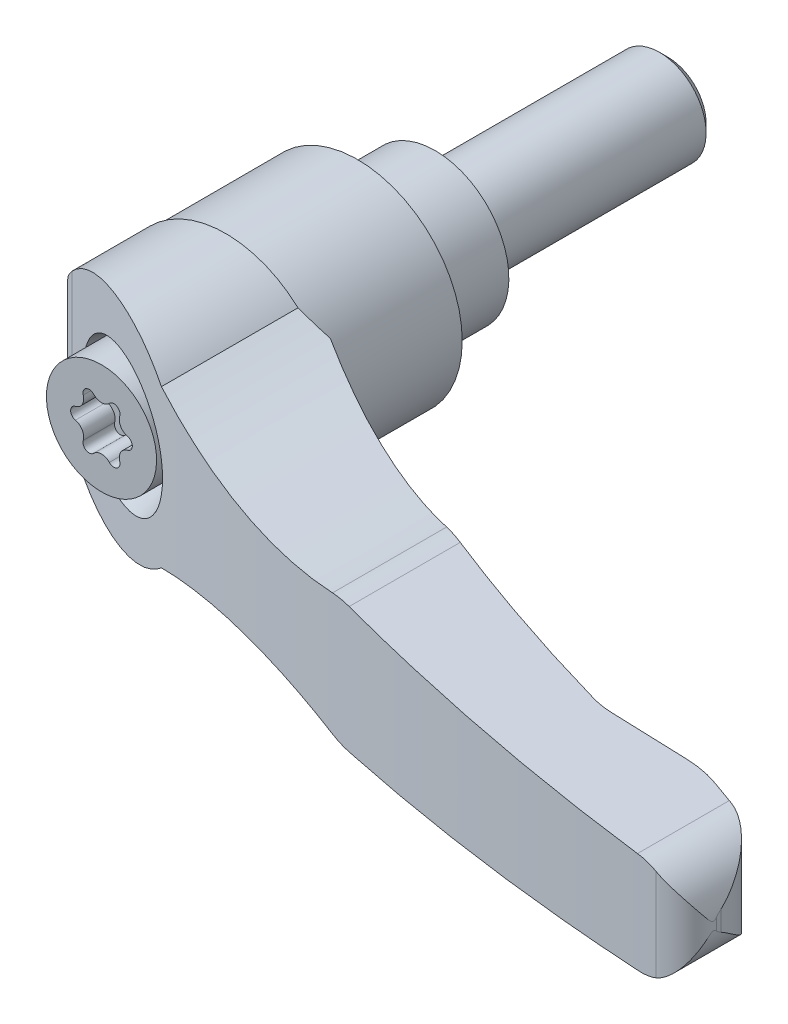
ISO-10303-21;
HEADER;
FILE_DESCRIPTION(('STEP AP214'),'2;1');
FILE_NAME('part.step','',(''),(''),'','','');
FILE_SCHEMA(('AUTOMOTIVE_DESIGN { 1 0 10303 214 1 1 1 1 }'));
ENDSEC;
DATA;
#1=APPLICATION_CONTEXT('core data for automotive mechanical design processes');
#2=APPLICATION_PROTOCOL_DEFINITION('international standard','automotive_design',2000,#1);
#3=PRODUCT_CONTEXT('',#1,'mechanical');
#4=PRODUCT('Part','Part','',(#3));
#5=PRODUCT_RELATED_PRODUCT_CATEGORY('part','',(#4));
#6=PRODUCT_DEFINITION_FORMATION('','',#4);
#7=PRODUCT_DEFINITION_CONTEXT('part definition',#1,'design');
#8=PRODUCT_DEFINITION('design','',#6,#7);
#9=PRODUCT_DEFINITION_SHAPE('','',#8);
#10=(LENGTH_UNIT() NAMED_UNIT(*) SI_UNIT(.MILLI.,.METRE.));
#11=(NAMED_UNIT(*) PLANE_ANGLE_UNIT() SI_UNIT($,.RADIAN.));
#12=(NAMED_UNIT(*) SI_UNIT($,.STERADIAN.) SOLID_ANGLE_UNIT());
#13=UNCERTAINTY_MEASURE_WITH_UNIT(LENGTH_MEASURE(1.E-05),#10,'distance_accuracy_value','');
#14=(GEOMETRIC_REPRESENTATION_CONTEXT(3) GLOBAL_UNCERTAINTY_ASSIGNED_CONTEXT((#13)) GLOBAL_UNIT_ASSIGNED_CONTEXT((#10,
#11,#12)) REPRESENTATION_CONTEXT('',''));
#15=CARTESIAN_POINT('',(0.,0.,0.));
#16=DIRECTION('',(0.,0.,1.));
#17=DIRECTION('',(1.,0.,0.));
#18=AXIS2_PLACEMENT_3D('',#15,#16,#17);
#19=CARTESIAN_POINT('',(0.,0.,-11.962456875));
#20=DIRECTION('',(0.,0.,-1.));
#21=DIRECTION('',(0.,1.,0.));
#22=AXIS2_PLACEMENT_3D('',#19,#20,#21);
#23=CYLINDRICAL_SURFACE('',#22,6.);
#24=CARTESIAN_POINT('',(0.,0.,-28.92));
#25=DIRECTION('',(0.,0.,-1.));
#26=DIRECTION('',(0.,1.,0.));
#27=AXIS2_PLACEMENT_3D('',#24,#25,#26);
#28=CIRCLE('',#27,6.);
#29=CARTESIAN_POINT('',(0.,6.,-28.92));
#30=VERTEX_POINT('',#29);
#31=EDGE_CURVE('E9',#30,#30,#28,.F.);
#32=ORIENTED_EDGE('',*,*,#31,.T.);
#33=EDGE_LOOP('',(#32));
#34=FACE_BOUND('',#33,.T.);
#35=CARTESIAN_POINT('',(0.,0.,0.));
#36=DIRECTION('',(0.,0.,-1.));
#37=DIRECTION('',(0.,1.,0.));
#38=AXIS2_PLACEMENT_3D('',#35,#36,#37);
#39=CIRCLE('',#38,6.);
#40=CARTESIAN_POINT('',(0.,6.,0.));
#41=VERTEX_POINT('',#40);
#42=EDGE_CURVE('E243',#41,#41,#39,.F.);
#43=ORIENTED_EDGE('',*,*,#42,.F.);
#44=EDGE_LOOP('',(#43));
#45=FACE_BOUND('',#44,.T.);
#46=ADVANCED_FACE('F14',(#34,#45),#23,.T.);
#47=CARTESIAN_POINT('',(7.75,0.,0.));
#48=DIRECTION('',(0.,0.,-1.));
#49=DIRECTION('',(0.,1.,0.));
#50=AXIS2_PLACEMENT_3D('',#47,#48,#49);
#51=PLANE('',#50);
#52=ORIENTED_EDGE('',*,*,#42,.T.);
#53=EDGE_LOOP('',(#52));
#54=FACE_BOUND('',#53,.T.);
#55=CARTESIAN_POINT('',(0.,0.,0.));
#56=DIRECTION('',(0.,0.,-1.));
#57=DIRECTION('',(0.,1.,0.));
#58=AXIS2_PLACEMENT_3D('',#55,#56,#57);
#59=CIRCLE('',#58,9.5);
#60=CARTESIAN_POINT('',(0.,9.5,0.));
#61=VERTEX_POINT('',#60);
#62=EDGE_CURVE('E784',#61,#61,#59,.F.);
#63=ORIENTED_EDGE('',*,*,#62,.F.);
#64=EDGE_LOOP('',(#63));
#65=FACE_BOUND('',#64,.T.);
#66=ADVANCED_FACE('F822',(#54,#65),#51,.T.);
#67=CARTESIAN_POINT('',(0.,0.,12.4));
#68=DIRECTION('',(0.,0.,-1.));
#69=DIRECTION('',(0.,1.,0.));
#70=AXIS2_PLACEMENT_3D('',#67,#68,#69);
#71=CYLINDRICAL_SURFACE('',#70,9.5);
#72=ORIENTED_EDGE('',*,*,#62,.T.);
#73=EDGE_LOOP('',(#72));
#74=FACE_BOUND('',#73,.T.);
#75=CARTESIAN_POINT('',(0.,0.,10.7));
#76=DIRECTION('',(0.,0.,-1.));
#77=DIRECTION('',(1.,0.,0.));
#78=AXIS2_PLACEMENT_3D('',#75,#76,#77);
#79=CIRCLE('',#78,9.5);
#80=CARTESIAN_POINT('',(9.5,0.,10.7));
#81=VERTEX_POINT('',#80);
#82=EDGE_CURVE('E326',#81,#81,#79,.T.);
#83=ORIENTED_EDGE('',*,*,#82,.T.);
#84=EDGE_LOOP('',(#83));
#85=FACE_BOUND('',#84,.T.);
#86=ADVANCED_FACE('F584',(#74,#85),#71,.T.);
#87=CARTESIAN_POINT('',(0.,0.,10.4));
#88=DIRECTION('',(0.,0.,-1.));
#89=DIRECTION('',(0.,1.,0.));
#90=AXIS2_PLACEMENT_3D('',#87,#88,#89);
#91=CONICAL_SURFACE('',#90,9.8,0.785398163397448);
#92=ORIENTED_EDGE('',*,*,#82,.F.);
#93=EDGE_LOOP('',(#92));
#94=FACE_BOUND('',#93,.T.);
#95=CARTESIAN_POINT('',(0.,0.,10.4));
#96=DIRECTION('',(0.,0.,-1.));
#97=DIRECTION('',(0.,1.,0.));
#98=AXIS2_PLACEMENT_3D('',#95,#96,#97);
#99=CIRCLE('',#98,9.8);
#100=CARTESIAN_POINT('',(0.,9.8,10.4));
#101=VERTEX_POINT('',#100);
#102=EDGE_CURVE('E322',#101,#101,#99,.T.);
#103=ORIENTED_EDGE('',*,*,#102,.T.);
#104=EDGE_LOOP('',(#103));
#105=FACE_BOUND('',#104,.T.);
#106=ADVANCED_FACE('F585',(#94,#105),#91,.F.);
#107=CARTESIAN_POINT('',(0.,0.,9.7));
#108=DIRECTION('',(0.,0.,-1.));
#109=DIRECTION('',(0.,1.,0.));
#110=AXIS2_PLACEMENT_3D('',#107,#108,#109);
#111=CYLINDRICAL_SURFACE('',#110,9.8);
#112=ORIENTED_EDGE('',*,*,#102,.F.);
#113=EDGE_LOOP('',(#112));
#114=FACE_BOUND('',#113,.T.);
#115=CARTESIAN_POINT('',(0.,0.,10.));
#116=DIRECTION('',(0.,0.,-1.));
#117=DIRECTION('',(0.,1.,0.));
#118=AXIS2_PLACEMENT_3D('',#115,#116,#117);
#119=CIRCLE('',#118,9.8);
#120=CARTESIAN_POINT('',(0.,9.8,10.));
#121=VERTEX_POINT('',#120);
#122=EDGE_CURVE('E325',#121,#121,#119,.F.);
#123=ORIENTED_EDGE('',*,*,#122,.F.);
#124=EDGE_LOOP('',(#123));
#125=FACE_BOUND('',#124,.T.);
#126=ADVANCED_FACE('F588',(#114,#125),#111,.F.);
#127=CARTESIAN_POINT('',(-13.2600377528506,-27.5,10.));
#128=DIRECTION('',(0.707106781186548,0.,0.707106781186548));
#129=DIRECTION('',(-0.707106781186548,0.,0.707106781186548));
#130=AXIS2_PLACEMENT_3D('',#127,#128,#129);
#131=PLANE('',#130);
#132=DIRECTION('',(0.,1.,0.));
#133=VECTOR('',#132,1.);
#134=CARTESIAN_POINT('',(-13.2600377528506,0.,10.));
#135=LINE('',#134,#133);
#136=CARTESIAN_POINT('',(-13.2600377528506,-2.58582666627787,10.));
#137=VERTEX_POINT('',#136);
#138=CARTESIAN_POINT('',(-13.2600377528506,2.58582666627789,10.));
#139=VERTEX_POINT('',#138);
#140=EDGE_CURVE('E770',#137,#139,#135,.T.);
#141=ORIENTED_EDGE('',*,*,#140,.F.);
#142=CARTESIAN_POINT('',(-0.00999999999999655,0.,-3.25003775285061));
#143=DIRECTION('',(0.707106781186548,0.,0.707106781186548));
#144=DIRECTION('',(-0.707106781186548,0.,0.707106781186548));
#145=AXIS2_PLACEMENT_3D('',#142,#143,#144);
#146=ELLIPSE('',#145,19.0918830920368,13.5);
#147=EDGE_CURVE('E772',#139,#137,#146,.T.);
#148=ORIENTED_EDGE('',*,*,#147,.F.);
#149=EDGE_LOOP('',(#141,#148));
#150=FACE_BOUND('',#149,.T.);
#151=ADVANCED_FACE('F592',(#150),#131,.F.);
#152=CARTESIAN_POINT('',(-6.76,0.,10.));
#153=DIRECTION('',(0.,0.,-1.));
#154=DIRECTION('',(0.,1.,0.));
#155=AXIS2_PLACEMENT_3D('',#152,#153,#154);
#156=PLANE('',#155);
#157=ORIENTED_EDGE('',*,*,#140,.T.);
#158=CARTESIAN_POINT('',(-0.00999999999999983,0.,10.));
#159=DIRECTION('',(0.,0.,1.));
#160=DIRECTION('',(-1.,0.,0.));
#161=AXIS2_PLACEMENT_3D('',#158,#159,#160);
#162=CIRCLE('',#161,13.5);
#163=EDGE_CURVE('E775',#137,#139,#162,.T.);
#164=ORIENTED_EDGE('',*,*,#163,.F.);
#165=EDGE_LOOP('',(#157,#164));
#166=FACE_BOUND('',#165,.T.);
#167=ORIENTED_EDGE('',*,*,#122,.T.);
#168=EDGE_LOOP('',(#167));
#169=FACE_BOUND('',#168,.T.);
#170=ADVANCED_FACE('F596',(#166,#169),#156,.T.);
#171=CARTESIAN_POINT('',(-0.0100000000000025,0.,20.75));
#172=DIRECTION('',(0.,0.,1.));
#173=DIRECTION('',(-1.,0.,0.));
#174=AXIS2_PLACEMENT_3D('',#171,#172,#173);
#175=CYLINDRICAL_SURFACE('',#174,13.5);
#176=ORIENTED_EDGE('',*,*,#163,.T.);
#177=ORIENTED_EDGE('',*,*,#147,.T.);
#178=EDGE_LOOP('',(#176,#177));
#179=FACE_BOUND('',#178,.T.);
#180=CARTESIAN_POINT('',(-0.010000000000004,0.,27.));
#181=DIRECTION('',(0.,0.,1.));
#182=DIRECTION('',(-1.,0.,0.));
#183=AXIS2_PLACEMENT_3D('',#180,#181,#182);
#184=CIRCLE('',#183,13.5);
#185=CARTESIAN_POINT('',(-13.51,0.,27.));
#186=VERTEX_POINT('',#185);
#187=CARTESIAN_POINT('',(13.4899999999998,0.,27.));
#188=VERTEX_POINT('',#187);
#189=EDGE_CURVE('E311',#186,#188,#184,.T.);
#190=ORIENTED_EDGE('',*,*,#189,.F.);
#191=CARTESIAN_POINT('',(-0.010000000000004,0.,27.));
#192=DIRECTION('',(0.,0.,1.));
#193=DIRECTION('',(-1.,0.,0.));
#194=AXIS2_PLACEMENT_3D('',#191,#192,#193);
#195=CIRCLE('',#194,13.5);
#196=EDGE_CURVE('E316',#188,#186,#195,.T.);
#197=ORIENTED_EDGE('',*,*,#196,.F.);
#198=EDGE_LOOP('',(#190,#197));
#199=FACE_BOUND('',#198,.T.);
#200=ADVANCED_FACE('F600',(#179,#199),#175,.T.);
#201=CARTESIAN_POINT('',(94.8688366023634,-14.75,58.0130023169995));
#202=DIRECTION('',(0.992331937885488,0.,-0.123601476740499));
#203=DIRECTION('',(0.123601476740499,0.,0.992331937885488));
#204=AXIS2_PLACEMENT_3D('',#201,#202,#203);
#205=PLANE('',#204);
#206=CARTESIAN_POINT('',(88.5,0.,6.88092740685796));
#207=DIRECTION('',(0.992331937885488,0.,-0.123601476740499));
#208=DIRECTION('',(0.123601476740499,0.,0.992331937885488));
#209=AXIS2_PLACEMENT_3D('',#206,#207,#208);
#210=ELLIPSE('',#209,52.588368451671,6.5);
#211=CARTESIAN_POINT('',(94.9511621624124,-0.795302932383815,58.6739513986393));
#212=VERTEX_POINT('',#211);
#213=CARTESIAN_POINT('',(94.8688366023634,-1.29919988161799,58.0130023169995));
#214=VERTEX_POINT('',#213);
#215=EDGE_CURVE('E768',#212,#214,#210,.T.);
#216=ORIENTED_EDGE('',*,*,#215,.T.);
#217=DIRECTION('',(0.,-1.,0.));
#218=VECTOR('',#217,1.);
#219=CARTESIAN_POINT('',(94.8688366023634,-14.75,58.0130023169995));
#220=LINE('',#219,#218);
#221=CARTESIAN_POINT('',(94.8688366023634,1.29919988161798,58.0130023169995));
#222=VERTEX_POINT('',#221);
#223=EDGE_CURVE('E303',#222,#214,#220,.T.);
#224=ORIENTED_EDGE('',*,*,#223,.F.);
#225=CARTESIAN_POINT('',(88.5,0.,6.88092740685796));
#226=DIRECTION('',(0.992331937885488,0.,-0.123601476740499));
#227=DIRECTION('',(0.123601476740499,0.,0.992331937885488));
#228=AXIS2_PLACEMENT_3D('',#225,#226,#227);
#229=ELLIPSE('',#228,52.588368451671,6.5);
#230=CARTESIAN_POINT('',(94.9511621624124,0.795302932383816,58.6739513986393));
#231=VERTEX_POINT('',#230);
#232=EDGE_CURVE('E769',#222,#231,#229,.T.);
#233=ORIENTED_EDGE('',*,*,#232,.T.);
#234=DIRECTION('',(0.,-1.,0.));
#235=VECTOR('',#234,1.);
#236=CARTESIAN_POINT('',(94.9511621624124,-14.75,58.6739513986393));
#237=LINE('',#236,#235);
#238=EDGE_CURVE('E765',#231,#212,#237,.T.);
#239=ORIENTED_EDGE('',*,*,#238,.T.);
#240=EDGE_LOOP('',(#216,#224,#233,#239));
#241=FACE_BOUND('',#240,.T.);
#242=ADVANCED_FACE('F604',(#241),#205,.T.);
#243=CARTESIAN_POINT('',(-13.51,-14.75,27.));
#244=DIRECTION('',(0.,0.,-1.));
#245=DIRECTION('',(0.,1.,0.));
#246=AXIS2_PLACEMENT_3D('',#243,#244,#245);
#247=PLANE('',#246);
#248=DIRECTION('',(0.,-1.,0.));
#249=VECTOR('',#248,1.);
#250=CARTESIAN_POINT('',(-13.51,-14.75,27.));
#251=LINE('',#250,#249);
#252=CARTESIAN_POINT('',(-13.51,2.55781156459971,27.));
#253=VERTEX_POINT('',#252);
#254=EDGE_CURVE('E312',#253,#186,#251,.T.);
#255=ORIENTED_EDGE('',*,*,#254,.F.);
#256=CARTESIAN_POINT('',(0.,0.,27.));
#257=DIRECTION('',(0.,0.,1.));
#258=DIRECTION('',(0.,-1.,0.));
#259=AXIS2_PLACEMENT_3D('',#256,#257,#258);
#260=CIRCLE('',#259,13.75);
#261=CARTESIAN_POINT('',(9.32365402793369,10.1060365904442,27.));
#262=VERTEX_POINT('',#261);
#263=EDGE_CURVE('E488',#262,#253,#260,.T.);
#264=ORIENTED_EDGE('',*,*,#263,.F.);
#265=CARTESIAN_POINT('',(29.15,64.91,27.));
#266=DIRECTION('',(0.,0.,1.));
#267=DIRECTION('',(0.,-1.,0.));
#268=AXIS2_PLACEMENT_3D('',#265,#266,#267);
#269=CIRCLE('',#268,58.28);
#270=CARTESIAN_POINT('',(13.4899999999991,8.77335599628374,27.));
#271=VERTEX_POINT('',#270);
#272=EDGE_CURVE('E450',#262,#271,#269,.T.);
#273=ORIENTED_EDGE('',*,*,#272,.T.);
#274=DIRECTION('',(0.,-1.,0.));
#275=VECTOR('',#274,1.);
#276=CARTESIAN_POINT('',(13.4899999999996,-14.75,27.0000000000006));
#277=LINE('',#276,#275);
#278=EDGE_CURVE('E307',#271,#188,#277,.T.);
#279=ORIENTED_EDGE('',*,*,#278,.T.);
#280=ORIENTED_EDGE('',*,*,#196,.T.);
#281=EDGE_LOOP('',(#255,#264,#273,#279,#280));
#282=FACE_BOUND('',#281,.T.);
#283=ADVANCED_FACE('F608',(#282),#247,.T.);
#284=CARTESIAN_POINT('',(-13.51,-14.75,31.4135672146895));
#285=DIRECTION('',(-1.,0.,0.));
#286=DIRECTION('',(0.,-1.,0.));
#287=AXIS2_PLACEMENT_3D('',#284,#285,#286);
#288=PLANE('',#287);
#289=DIRECTION('',(0.,0.,1.));
#290=VECTOR('',#289,1.);
#291=CARTESIAN_POINT('',(-13.51,-2.5578115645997,63.));
#292=LINE('',#291,#290);
#293=CARTESIAN_POINT('',(-13.51,-2.55781156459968,31.4135672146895));
#294=VERTEX_POINT('',#293);
#295=CARTESIAN_POINT('',(-13.51,-2.55781156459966,27.));
#296=VERTEX_POINT('',#295);
#297=EDGE_CURVE('E315',#294,#296,#292,.F.);
#298=ORIENTED_EDGE('',*,*,#297,.F.);
#299=DIRECTION('',(0.,-1.,0.));
#300=VECTOR('',#299,1.);
#301=CARTESIAN_POINT('',(-13.51,-14.75,31.4135672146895));
#302=LINE('',#301,#300);
#303=CARTESIAN_POINT('',(-13.51,2.55781156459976,31.4135672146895));
#304=VERTEX_POINT('',#303);
#305=EDGE_CURVE('E502',#304,#294,#302,.T.);
#306=ORIENTED_EDGE('',*,*,#305,.F.);
#307=DIRECTION('',(0.,0.,1.));
#308=VECTOR('',#307,1.);
#309=CARTESIAN_POINT('',(-13.51,2.55781156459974,63.));
#310=LINE('',#309,#308);
#311=EDGE_CURVE('E491',#253,#304,#310,.T.);
#312=ORIENTED_EDGE('',*,*,#311,.F.);
#313=ORIENTED_EDGE('',*,*,#254,.T.);
#314=DIRECTION('',(0.,1.,0.));
#315=VECTOR('',#314,1.);
#316=CARTESIAN_POINT('',(-13.51,-14.75,27.));
#317=LINE('',#316,#315);
#318=EDGE_CURVE('E750',#296,#186,#317,.T.);
#319=ORIENTED_EDGE('',*,*,#318,.F.);
#320=EDGE_LOOP('',(#298,#306,#312,#313,#319));
#321=FACE_BOUND('',#320,.T.);
#322=ADVANCED_FACE('F612',(#321),#288,.T.);
#323=CARTESIAN_POINT('',(-13.51,-14.75,27.));
#324=DIRECTION('',(0.,0.,-1.));
#325=DIRECTION('',(0.,1.,0.));
#326=AXIS2_PLACEMENT_3D('',#323,#324,#325);
#327=PLANE('',#326);
#328=ORIENTED_EDGE('',*,*,#189,.T.);
#329=DIRECTION('',(0.,-1.,0.));
#330=VECTOR('',#329,1.);
#331=CARTESIAN_POINT('',(13.4899999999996,-14.75,27.0000000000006));
#332=LINE('',#331,#330);
#333=CARTESIAN_POINT('',(13.4899999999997,-8.77335599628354,27.));
#334=VERTEX_POINT('',#333);
#335=EDGE_CURVE('E741',#188,#334,#332,.T.);
#336=ORIENTED_EDGE('',*,*,#335,.T.);
#337=CARTESIAN_POINT('',(29.15,-64.91,27.));
#338=DIRECTION('',(0.,0.,1.));
#339=DIRECTION('',(0.,-1.,0.));
#340=AXIS2_PLACEMENT_3D('',#337,#338,#339);
#341=CIRCLE('',#340,58.28);
#342=CARTESIAN_POINT('',(9.32365402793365,-10.1060365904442,27.));
#343=VERTEX_POINT('',#342);
#344=EDGE_CURVE('E737',#334,#343,#341,.T.);
#345=ORIENTED_EDGE('',*,*,#344,.T.);
#346=CARTESIAN_POINT('',(0.,0.,27.));
#347=DIRECTION('',(0.,0.,1.));
#348=DIRECTION('',(0.,-1.,0.));
#349=AXIS2_PLACEMENT_3D('',#346,#347,#348);
#350=CIRCLE('',#349,13.75);
#351=EDGE_CURVE('E736',#296,#343,#350,.T.);
#352=ORIENTED_EDGE('',*,*,#351,.F.);
#353=ORIENTED_EDGE('',*,*,#318,.T.);
#354=EDGE_LOOP('',(#328,#336,#345,#352,#353));
#355=FACE_BOUND('',#354,.T.);
#356=ADVANCED_FACE('F616',(#355),#327,.T.);
#357=CARTESIAN_POINT('',(81.4673032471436,-14.75,62.36));
#358=DIRECTION('',(0.,-1.,0.));
#359=DIRECTION('',(1.,0.,0.));
#360=AXIS2_PLACEMENT_3D('',#357,#358,#359);
#361=CYLINDRICAL_SURFACE('',#360,13.39);
#362=CARTESIAN_POINT('',(81.4673032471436,-6.75541913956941,62.36));
#363=DIRECTION('',(-0.0362948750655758,0.999341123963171,0.));
#364=DIRECTION('',(-0.999341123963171,-0.0362948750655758,0.));
#365=AXIS2_PLACEMENT_3D('',#362,#363,#364);
#366=ELLIPSE('',#365,13.3988281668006,13.39);
#367=CARTESIAN_POINT('',(85.7182287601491,-6.60103060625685,49.6626879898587));
#368=VERTEX_POINT('',#367);
#369=CARTESIAN_POINT('',(81.4673032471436,-6.75541913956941,48.97));
#370=VERTEX_POINT('',#369);
#371=EDGE_CURVE('E640',#368,#370,#366,.T.);
#372=ORIENTED_EDGE('',*,*,#371,.T.);
#373=DIRECTION('',(0.,1.,0.));
#374=VECTOR('',#373,1.);
#375=CARTESIAN_POINT('',(81.4673032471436,-14.75,48.97));
#376=LINE('',#375,#374);
#377=CARTESIAN_POINT('',(81.4673032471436,6.75541913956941,48.97));
#378=VERTEX_POINT('',#377);
#379=EDGE_CURVE('E308',#378,#370,#376,.F.);
#380=ORIENTED_EDGE('',*,*,#379,.F.);
#381=CARTESIAN_POINT('',(81.4673032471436,6.75541913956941,62.36));
#382=DIRECTION('',(-0.0362948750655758,-0.999341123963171,0.));
#383=DIRECTION('',(0.999341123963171,-0.0362948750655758,0.));
#384=AXIS2_PLACEMENT_3D('',#381,#382,#383);
#385=ELLIPSE('',#384,13.3988281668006,13.39);
#386=CARTESIAN_POINT('',(85.7182287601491,6.60103060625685,49.6626879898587));
#387=VERTEX_POINT('',#386);
#388=EDGE_CURVE('E452',#378,#387,#385,.T.);
#389=ORIENTED_EDGE('',*,*,#388,.T.);
#390=DIRECTION('',(0.,-1.,0.));
#391=VECTOR('',#390,1.);
#392=CARTESIAN_POINT('',(85.7182287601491,-14.75,49.6626879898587));
#393=LINE('',#392,#391);
#394=EDGE_CURVE('E300',#368,#387,#393,.F.);
#395=ORIENTED_EDGE('',*,*,#394,.F.);
#396=EDGE_LOOP('',(#372,#380,#389,#395));
#397=FACE_BOUND('',#396,.T.);
#398=ADVANCED_FACE('F620',(#397),#361,.T.);
#399=CARTESIAN_POINT('',(71.6523269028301,-14.75,48.97));
#400=DIRECTION('',(0.,0.,-1.));
#401=DIRECTION('',(0.,1.,0.));
#402=AXIS2_PLACEMENT_3D('',#399,#400,#401);
#403=PLANE('',#402);
#404=DIRECTION('',(-0.999341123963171,-0.0362948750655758,0.));
#405=VECTOR('',#404,1.);
#406=CARTESIAN_POINT('',(88.5,-6.5,48.97));
#407=LINE('',#406,#405);
#408=CARTESIAN_POINT('',(71.6523269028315,-7.11188734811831,48.97));
#409=VERTEX_POINT('',#408);
#410=EDGE_CURVE('E632',#370,#409,#407,.T.);
#411=ORIENTED_EDGE('',*,*,#410,.T.);
#412=DIRECTION('',(0.,-1.,0.));
#413=VECTOR('',#412,1.);
#414=CARTESIAN_POINT('',(71.6523269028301,-14.75,48.97));
#415=LINE('',#414,#413);
#416=CARTESIAN_POINT('',(71.6523269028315,7.11188734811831,48.97));
#417=VERTEX_POINT('',#416);
#418=EDGE_CURVE('E305',#409,#417,#415,.F.);
#419=ORIENTED_EDGE('',*,*,#418,.T.);
#420=DIRECTION('',(0.999341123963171,-0.0362948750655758,0.));
#421=VECTOR('',#420,1.);
#422=CARTESIAN_POINT('',(43.9670619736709,8.1173830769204,48.97));
#423=LINE('',#422,#421);
#424=EDGE_CURVE('E760',#417,#378,#423,.T.);
#425=ORIENTED_EDGE('',*,*,#424,.T.);
#426=ORIENTED_EDGE('',*,*,#379,.T.);
#427=EDGE_LOOP('',(#411,#419,#425,#426));
#428=FACE_BOUND('',#427,.T.);
#429=ADVANCED_FACE('F623',(#428),#403,.T.);
#430=CARTESIAN_POINT('',(71.6523269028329,-14.75,38.8899999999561));
#431=DIRECTION('',(0.,-1.,0.));
#432=DIRECTION('',(1.,0.,0.));
#433=AXIS2_PLACEMENT_3D('',#430,#431,#432);
#434=CYLINDRICAL_SURFACE('',#433,10.0800000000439);
#435=ORIENTED_EDGE('',*,*,#418,.F.);
#436=CARTESIAN_POINT('',(71.6523269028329,-7.11188734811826,38.8899999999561));
#437=DIRECTION('',(-0.0362948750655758,0.999341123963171,0.));
#438=DIRECTION('',(-0.999341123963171,-0.0362948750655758,0.));
#439=AXIS2_PLACEMENT_3D('',#436,#437,#438);
#440=ELLIPSE('',#439,10.086645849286,10.0800000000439);
#441=CARTESIAN_POINT('',(69.1344137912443,-7.20333494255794,48.6504566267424));
#442=VERTEX_POINT('',#441);
#443=EDGE_CURVE('E639',#409,#442,#440,.F.);
#444=ORIENTED_EDGE('',*,*,#443,.T.);
#445=DIRECTION('',(0.,-1.,0.));
#446=VECTOR('',#445,1.);
#447=CARTESIAN_POINT('',(69.1344156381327,-14.75,48.6504571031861));
#448=LINE('',#447,#446);
#449=CARTESIAN_POINT('',(69.1344137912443,7.20333494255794,48.6504566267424));
#450=VERTEX_POINT('',#449);
#451=EDGE_CURVE('E744',#442,#450,#448,.F.);
#452=ORIENTED_EDGE('',*,*,#451,.T.);
#453=CARTESIAN_POINT('',(71.6523269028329,7.11188734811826,38.8899999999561));
#454=DIRECTION('',(-0.0362948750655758,-0.999341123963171,0.));
#455=DIRECTION('',(0.999341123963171,-0.0362948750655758,0.));
#456=AXIS2_PLACEMENT_3D('',#453,#454,#455);
#457=ELLIPSE('',#456,10.086645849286,10.0800000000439);
#458=EDGE_CURVE('E643',#450,#417,#457,.F.);
#459=ORIENTED_EDGE('',*,*,#458,.T.);
#460=EDGE_LOOP('',(#435,#444,#452,#459));
#461=FACE_BOUND('',#460,.T.);
#462=ADVANCED_FACE('F460',(#461),#434,.F.);
#463=CARTESIAN_POINT('',(132.162219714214,-14.75,-195.670803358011));
#464=DIRECTION('',(0.,-1.,0.));
#465=DIRECTION('',(1.,0.,0.));
#466=AXIS2_PLACEMENT_3D('',#463,#464,#465);
#467=CYLINDRICAL_SURFACE('',#466,252.32);
#468=CARTESIAN_POINT('',(43.9670619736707,8.11738307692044,40.7335040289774));
#469=CARTESIAN_POINT('',(43.7285909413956,8.12604852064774,40.6445396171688));
#470=CARTESIAN_POINT('',(43.4900264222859,8.12742192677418,40.5551257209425));
#471=CARTESIAN_POINT('',(43.014251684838,8.11567103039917,40.375985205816));
#472=CARTESIAN_POINT('',(42.7770395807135,8.10259351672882,40.2862605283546));
#473=CARTESIAN_POINT('',(42.3039618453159,8.06208212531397,40.1065066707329));
#474=CARTESIAN_POINT('',(42.0680962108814,8.03464828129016,40.0164774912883));
#475=CARTESIAN_POINT('',(41.5977019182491,7.96541677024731,39.8361272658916));
#476=CARTESIAN_POINT('',(41.3631800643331,7.92357286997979,39.7458062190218));
#477=CARTESIAN_POINT('',(41.1300932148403,7.87460952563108,39.6556387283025));
#478=B_SPLINE_CURVE_WITH_KNOTS('',3,(#468,#469,#470,#471,#472,#473,#474,#475,#476,#477),
.UNSPECIFIED.,.F.,.F.,(4,2,2,2,4),(0.,0.763908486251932,1.52535083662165,2.28679139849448,
3.05069808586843),.UNSPECIFIED.);
#479=CARTESIAN_POINT('',(43.9670619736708,8.11738307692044,40.7335040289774));
#480=VERTEX_POINT('',#479);
#481=CARTESIAN_POINT('',(41.1300932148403,7.87460952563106,39.6556387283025));
#482=VERTEX_POINT('',#481);
#483=EDGE_CURVE('E440',#480,#482,#478,.T.);
#484=ORIENTED_EDGE('',*,*,#483,.F.);
#485=CARTESIAN_POINT('',(132.162219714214,4.9142403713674,-195.670803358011));
#486=DIRECTION('',(-0.0362948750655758,-0.999341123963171,0.));
#487=DIRECTION('',(0.999341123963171,-0.0362948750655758,0.));
#488=AXIS2_PLACEMENT_3D('',#485,#486,#487);
#489=ELLIPSE('',#488,252.486357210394,252.32);
#490=EDGE_CURVE('E715',#480,#450,#489,.F.);
#491=ORIENTED_EDGE('',*,*,#490,.T.);
#492=ORIENTED_EDGE('',*,*,#451,.F.);
#493=CARTESIAN_POINT('',(132.162219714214,-4.91424037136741,-195.670803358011));
#494=DIRECTION('',(-0.0362948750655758,0.999341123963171,0.));
#495=DIRECTION('',(-0.999341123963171,-0.0362948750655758,0.));
#496=AXIS2_PLACEMENT_3D('',#493,#494,#495);
#497=ELLIPSE('',#496,252.486357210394,252.32);
#498=CARTESIAN_POINT('',(43.9670619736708,-8.11738307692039,40.7335040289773));
#499=VERTEX_POINT('',#498);
#500=EDGE_CURVE('E647',#442,#499,#497,.F.);
#501=ORIENTED_EDGE('',*,*,#500,.T.);
#502=CARTESIAN_POINT('',(41.1300929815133,-7.87460947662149,39.6556386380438));
#503=CARTESIAN_POINT('',(41.3631798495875,-7.92357282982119,39.7458061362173));
#504=CARTESIAN_POINT('',(41.5977017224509,-7.96541673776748,39.8361271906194));
#505=CARTESIAN_POINT('',(42.0680960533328,-8.03464826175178,40.0164774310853));
#506=CARTESIAN_POINT('',(42.3039617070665,-8.06208211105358,40.1065066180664));
#507=CARTESIAN_POINT('',(42.7770394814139,-8.10259351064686,40.2862604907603));
#508=CARTESIAN_POINT('',(43.0142516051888,-8.11567102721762,40.3759851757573));
#509=CARTESIAN_POINT('',(43.4900263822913,-8.12742192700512,40.5551257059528));
#510=CARTESIAN_POINT('',(43.7285909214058,-8.12604852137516,40.6445396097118));
#511=CARTESIAN_POINT('',(43.9670619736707,-8.11738307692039,40.7335040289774));
#512=B_SPLINE_CURVE_WITH_KNOTS('',3,(#502,#503,#504,#505,#506,#507,#508,#509,#510,#511),
.UNSPECIFIED.,.F.,.F.,(4,2,2,2,4),(0.,0.763906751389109,1.52534737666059,2.28678979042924,
3.05069834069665),.UNSPECIFIED.);
#513=CARTESIAN_POINT('',(41.1300929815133,-7.8746094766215,39.6556386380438));
#514=VERTEX_POINT('',#513);
#515=EDGE_CURVE('E475',#514,#499,#512,.T.);
#516=ORIENTED_EDGE('',*,*,#515,.F.);
#517=CARTESIAN_POINT('',(41.1300929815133,-7.87460947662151,39.6556386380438));
#518=CARTESIAN_POINT('',(40.2468666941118,-7.68907790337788,39.3139933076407));
#519=CARTESIAN_POINT('',(39.3617638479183,-7.52459842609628,38.9658739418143));
#520=CARTESIAN_POINT('',(37.5897998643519,-7.23736069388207,38.2572801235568));
#521=CARTESIAN_POINT('',(36.7029388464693,-7.11459969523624,37.8968064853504));
#522=CARTESIAN_POINT('',(34.9294341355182,-6.91040287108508,37.1640922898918));
#523=CARTESIAN_POINT('',(34.0427904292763,-6.8289625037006,36.7918530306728));
#524=CARTESIAN_POINT('',(32.2715033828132,-6.70688253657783,36.0362417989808));
#525=CARTESIAN_POINT('',(31.3868600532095,-6.66624315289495,35.652869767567));
#526=CARTESIAN_POINT('',(28.7704435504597,-6.60545291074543,34.5011035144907));
#527=CARTESIAN_POINT('',(27.0436661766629,-6.64276527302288,33.7176215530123));
#528=CARTESIAN_POINT('',(23.6170342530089,-6.86784257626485,32.1161606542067));
#529=CARTESIAN_POINT('',(21.9171693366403,-7.05554807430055,31.2981954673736));
#530=CARTESIAN_POINT('',(19.6661800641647,-7.4039275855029,30.1840812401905));
#531=CARTESIAN_POINT('',(19.0983988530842,-7.50046620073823,29.9003744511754));
#532=CARTESIAN_POINT('',(17.9675115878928,-7.70999213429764,29.3299782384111));
#533=CARTESIAN_POINT('',(17.4044045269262,-7.82297580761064,29.043289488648));
#534=CARTESIAN_POINT('',(16.2796310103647,-8.06595772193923,28.4653390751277));
#535=CARTESIAN_POINT('',(15.7179955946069,-8.19605796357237,28.1740600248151));
#536=CARTESIAN_POINT('',(14.5999573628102,-8.472545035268,27.5889003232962));
#537=CARTESIAN_POINT('',(14.0435556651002,-8.61893526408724,27.2950191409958));
#538=CARTESIAN_POINT('',(13.4899999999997,-8.77335599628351,27.0000000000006));
#539=B_SPLINE_CURVE_WITH_KNOTS('',3,(#517,#518,#519,#520,#521,#522,#523,#524,#525,#526,#527,
#528,#529,#530,#531,#532,#533,#534,#535,#536,#537,#538),.UNSPECIFIED.,.F.,.F.,(4,2,2,2,2,2,2,2,
2,2,4),(0.,2.89469970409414,5.78920899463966,8.6834000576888,11.5776064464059,17.2602540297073,
22.940656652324,24.866551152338,26.7920194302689,28.7295308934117,30.6674473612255),.UNSPECIFIED.);
#540=EDGE_CURVE('E466',#514,#334,#539,.T.);
#541=ORIENTED_EDGE('',*,*,#540,.T.);
#542=ORIENTED_EDGE('',*,*,#335,.F.);
#543=ORIENTED_EDGE('',*,*,#278,.F.);
#544=CARTESIAN_POINT('',(13.4899999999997,8.77335599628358,27.0000000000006));
#545=CARTESIAN_POINT('',(14.31664655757,8.54275177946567,27.4405727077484));
#546=CARTESIAN_POINT('',(15.149663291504,8.33005321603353,27.8786057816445));
#547=CARTESIAN_POINT('',(16.82730612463,7.94113938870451,28.7487404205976));
#548=CARTESIAN_POINT('',(17.6719330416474,7.76492670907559,29.1808415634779));
#549=CARTESIAN_POINT('',(19.3724293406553,7.44952599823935,30.0386421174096));
#550=CARTESIAN_POINT('',(20.2283094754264,7.31037656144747,30.4643344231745));
#551=CARTESIAN_POINT('',(21.9491324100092,7.07004305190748,31.3079971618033));
#552=CARTESIAN_POINT('',(22.8140749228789,6.96885778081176,31.725967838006));
#553=CARTESIAN_POINT('',(24.5350860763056,6.80669813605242,32.5454832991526));
#554=CARTESIAN_POINT('',(25.3910090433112,6.74499321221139,32.9471893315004));
#555=CARTESIAN_POINT('',(27.1088771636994,6.65940525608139,33.7416486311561));
#556=CARTESIAN_POINT('',(27.9708222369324,6.63552172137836,34.1344020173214));
#557=CARTESIAN_POINT('',(29.6986634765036,6.62618362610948,34.9099811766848));
#558=CARTESIAN_POINT('',(30.5645565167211,6.64070263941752,35.2928135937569));
#559=CARTESIAN_POINT('',(32.2992228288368,6.70867652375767,36.0481188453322));
#560=CARTESIAN_POINT('',(33.1679956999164,6.76212618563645,36.4205930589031));
#561=CARTESIAN_POINT('',(34.6268488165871,6.88489763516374,37.0364018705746));
#562=CARTESIAN_POINT('',(35.2165959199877,6.94356774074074,37.2827020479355));
#563=CARTESIAN_POINT('',(36.396064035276,7.07916681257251,37.7700518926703));
#564=CARTESIAN_POINT('',(36.9857850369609,7.15609293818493,38.0111023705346));
#565=CARTESIAN_POINT('',(38.1685846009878,7.32890006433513,38.4893735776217));
#566=CARTESIAN_POINT('',(38.7616598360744,7.42490199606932,38.7265588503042));
#567=CARTESIAN_POINT('',(39.9468049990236,7.63566195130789,39.1953420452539));
#568=CARTESIAN_POINT('',(40.5388747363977,7.75042319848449,39.4269389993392));
#569=CARTESIAN_POINT('',(41.1300932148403,7.87460952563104,39.6556387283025));
#570=B_SPLINE_CURVE_WITH_KNOTS('',3,(#544,#545,#546,#547,#548,#549,#550,#551,#552,#553,#554,
#555,#556,#557,#558,#559,#560,#561,#562,#563,#564,#565,#566,#567,#568,#569),.UNSPECIFIED.,.F.,
.F.,(4,2,2,2,2,2,2,2,2,2,2,2,4),(0.,2.89390785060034,5.78802060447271,8.68513535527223,
11.5821586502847,14.4238937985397,17.2655911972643,20.1053336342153,22.9446961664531,
24.8698413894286,26.7946872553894,28.7321491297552,30.6699442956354),.UNSPECIFIED.);
#571=EDGE_CURVE('E481',#271,#482,#570,.T.);
#572=ORIENTED_EDGE('',*,*,#571,.T.);
#573=EDGE_LOOP('',(#484,#491,#492,#501,#516,#541,#542,#543,#572));
#574=FACE_BOUND('',#573,.T.);
#575=ADVANCED_FACE('F454',(#574),#467,.F.);
#576=CARTESIAN_POINT('',(85.7182287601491,-14.75,49.6626879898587));
#577=DIRECTION('',(0.317470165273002,0.,-0.948268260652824));
#578=DIRECTION('',(0.948268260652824,0.,0.317470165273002));
#579=AXIS2_PLACEMENT_3D('',#576,#577,#578);
#580=PLANE('',#579);
#581=DIRECTION('',(-0.947706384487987,-0.0344195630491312,-0.317282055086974));
#582=VECTOR('',#581,1.);
#583=CARTESIAN_POINT('',(88.5,-6.5,50.5939955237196));
#584=LINE('',#583,#582);
#585=CARTESIAN_POINT('',(88.5,-6.5,50.5939955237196));
#586=VERTEX_POINT('',#585);
#587=EDGE_CURVE('E661',#586,#368,#584,.T.);
#588=ORIENTED_EDGE('',*,*,#587,.T.);
#589=ORIENTED_EDGE('',*,*,#394,.T.);
#590=DIRECTION('',(0.947706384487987,-0.0344195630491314,0.317282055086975));
#591=VECTOR('',#590,1.);
#592=CARTESIAN_POINT('',(85.7182287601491,6.60103060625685,49.6626879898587));
#593=LINE('',#592,#591);
#594=CARTESIAN_POINT('',(88.5,6.5,50.5939955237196));
#595=VERTEX_POINT('',#594);
#596=EDGE_CURVE('E449',#387,#595,#593,.T.);
#597=ORIENTED_EDGE('',*,*,#596,.T.);
#598=CARTESIAN_POINT('',(88.5,0.,50.5939955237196));
#599=DIRECTION('',(0.317470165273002,0.,-0.948268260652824));
#600=DIRECTION('',(0.948268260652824,0.,0.317470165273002));
#601=AXIS2_PLACEMENT_3D('',#598,#599,#600);
#602=ELLIPSE('',#601,6.8546004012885,6.5);
#603=CARTESIAN_POINT('',(88.9098071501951,6.48706852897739,50.7311946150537));
#604=VERTEX_POINT('',#603);
#605=EDGE_CURVE('E320',#604,#595,#602,.F.);
#606=ORIENTED_EDGE('',*,*,#605,.F.);
#607=DIRECTION('',(0.,-1.,0.));
#608=VECTOR('',#607,1.);
#609=CARTESIAN_POINT('',(88.9098071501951,-14.75,50.7311946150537));
#610=LINE('',#609,#608);
#611=CARTESIAN_POINT('',(88.9098071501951,-6.4870685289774,50.7311946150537));
#612=VERTEX_POINT('',#611);
#613=EDGE_CURVE('E321',#612,#604,#610,.F.);
#614=ORIENTED_EDGE('',*,*,#613,.F.);
#615=CARTESIAN_POINT('',(88.5,0.,50.5939955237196));
#616=DIRECTION('',(0.317470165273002,0.,-0.948268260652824));
#617=DIRECTION('',(0.948268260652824,0.,0.317470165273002));
#618=AXIS2_PLACEMENT_3D('',#615,#616,#617);
#619=ELLIPSE('',#618,6.8546004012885,6.5);
#620=EDGE_CURVE('E304',#612,#586,#619,.T.);
#621=ORIENTED_EDGE('',*,*,#620,.T.);
#622=EDGE_LOOP('',(#588,#589,#597,#606,#614,#621));
#623=FACE_BOUND('',#622,.T.);
#624=ADVANCED_FACE('F459',(#623),#580,.T.);
#625=CARTESIAN_POINT('',(86.1065455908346,-14.75,59.1044033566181));
#626=DIRECTION('',(0.,-1.,0.));
#627=DIRECTION('',(1.,0.,0.));
#628=AXIS2_PLACEMENT_3D('',#625,#626,#627);
#629=CYLINDRICAL_SURFACE('',#628,8.83);
#630=CARTESIAN_POINT('',(88.9098071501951,-6.4870685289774,50.7311946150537));
#631=CARTESIAN_POINT('',(89.089769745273,-6.4757277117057,50.7913988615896));
#632=CARTESIAN_POINT('',(89.2672358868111,-6.4569733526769,50.8573067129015));
#633=CARTESIAN_POINT('',(89.6156587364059,-6.40594654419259,50.9994566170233));
#634=CARTESIAN_POINT('',(89.7866254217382,-6.37369580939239,51.0756819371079));
#635=CARTESIAN_POINT('',(90.1193873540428,-6.29733777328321,51.2367553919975));
#636=CARTESIAN_POINT('',(90.2812591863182,-6.25335658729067,51.3215061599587));
#637=CARTESIAN_POINT('',(90.5970344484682,-6.15465850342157,51.4993225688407));
#638=CARTESIAN_POINT('',(90.750933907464,-6.09993631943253,51.5923922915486));
#639=CARTESIAN_POINT('',(91.0845425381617,-5.96735555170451,51.8080731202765));
#640=CARTESIAN_POINT('',(91.2620732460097,-5.88706921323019,51.9325631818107));
#641=CARTESIAN_POINT('',(91.6037719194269,-5.71430400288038,52.1909876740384));
#642=CARTESIAN_POINT('',(91.7679381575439,-5.62182355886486,52.3249233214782));
#643=CARTESIAN_POINT('',(92.0835205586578,-5.42614069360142,52.6014136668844));
#644=CARTESIAN_POINT('',(92.2348770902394,-5.32289263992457,52.7440038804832));
#645=CARTESIAN_POINT('',(92.5241674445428,-5.10769832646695,53.036019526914));
#646=CARTESIAN_POINT('',(92.6621003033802,-4.99575144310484,53.1854454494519));
#647=CARTESIAN_POINT('',(92.9757333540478,-4.71982512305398,53.5491307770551));
#648=CARTESIAN_POINT('',(93.1453696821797,-4.552486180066,53.7660853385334));
#649=CARTESIAN_POINT('',(93.4603079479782,-4.20713466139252,54.208999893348));
#650=CARTESIAN_POINT('',(93.6056001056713,-4.02911783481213,54.4349634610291));
#651=CARTESIAN_POINT('',(93.8728003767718,-3.66523875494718,54.8943200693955));
#652=CARTESIAN_POINT('',(93.9947026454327,-3.47937455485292,55.1277149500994));
#653=CARTESIAN_POINT('',(94.2159458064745,-3.10252192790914,55.600867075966));
#654=CARTESIAN_POINT('',(94.3152909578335,-2.91153447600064,55.8406231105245));
#655=CARTESIAN_POINT('',(94.4598076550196,-2.59782196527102,56.2375651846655));
#656=CARTESIAN_POINT('',(94.5115034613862,-2.47567903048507,56.3928781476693));
#657=CARTESIAN_POINT('',(94.6062509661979,-2.23176482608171,56.7063336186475));
#658=CARTESIAN_POINT('',(94.6493059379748,-2.10999343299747,56.8644750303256));
#659=CARTESIAN_POINT('',(94.7073954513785,-1.92930841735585,57.1041561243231));
#660=CARTESIAN_POINT('',(94.7256435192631,-1.86953763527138,57.1842829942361));
#661=CARTESIAN_POINT('',(94.7600223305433,-1.75098004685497,57.3456972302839));
#662=CARTESIAN_POINT('',(94.7761533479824,-1.69219311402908,57.4269844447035));
#663=CARTESIAN_POINT('',(94.8063065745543,-1.57609424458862,57.5911123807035));
#664=CARTESIAN_POINT('',(94.8203269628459,-1.51878361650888,57.6739543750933));
#665=CARTESIAN_POINT('',(94.8462112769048,-1.4067606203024,57.8417526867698));
#666=CARTESIAN_POINT('',(94.8580742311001,-1.35204943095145,57.9267099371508));
#667=CARTESIAN_POINT('',(94.8688366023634,-1.29919988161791,58.0130023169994));
#668=B_SPLINE_CURVE_WITH_KNOTS('',3,(#630,#631,#632,#633,#634,#635,#636,#637,#638,#639,#640,
#641,#642,#643,#644,#645,#646,#647,#648,#649,#650,#651,#652,#653,#654,#655,#656,#657,#658,#659,
#660,#661,#662,#663,#664,#665,#666,#667),.UNSPECIFIED.,.F.,.F.,(4,2,2,2,2,2,2,2,2,2,2,2,2,2,2,2,
2,2,4),(0.,0.569903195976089,1.1388929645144,1.70199618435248,2.26537722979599,2.95800230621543,
3.6507167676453,4.3464963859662,5.04232592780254,6.00766077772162,6.97338251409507,
7.9393452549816,8.90512546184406,9.51766996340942,10.129981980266,10.4348045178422,
10.7395875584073,11.0446320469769,11.3498135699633),.UNSPECIFIED.);
#669=EDGE_CURVE('E362',#612,#214,#668,.T.);
#670=ORIENTED_EDGE('',*,*,#669,.F.);
#671=ORIENTED_EDGE('',*,*,#613,.T.);
#672=CARTESIAN_POINT('',(94.8688366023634,1.29919988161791,58.0130023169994));
#673=CARTESIAN_POINT('',(94.8598905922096,1.34309764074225,57.9412335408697));
#674=CARTESIAN_POINT('',(94.8501811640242,1.38833454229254,57.8704151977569));
#675=CARTESIAN_POINT('',(94.8292644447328,1.48075225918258,57.7303150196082));
#676=CARTESIAN_POINT('',(94.8180576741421,1.52793239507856,57.6610326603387));
#677=CARTESIAN_POINT('',(94.7822406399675,1.67127035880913,57.454961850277));
#678=CARTESIAN_POINT('',(94.7554216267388,1.76928633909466,57.3198547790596));
#679=CARTESIAN_POINT('',(94.6959351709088,1.96751896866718,57.0525736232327));
#680=CARTESIAN_POINT('',(94.6632668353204,2.06773595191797,56.9203999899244));
#681=CARTESIAN_POINT('',(94.5920450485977,2.26900598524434,56.6582540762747));
#682=CARTESIAN_POINT('',(94.5534905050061,2.37005918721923,56.5282822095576));
#683=CARTESIAN_POINT('',(94.4700311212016,2.57311073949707,56.2689600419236));
#684=CARTESIAN_POINT('',(94.4250680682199,2.67510870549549,56.1396281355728));
#685=CARTESIAN_POINT('',(94.3289987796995,2.87844084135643,55.8827641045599));
#686=CARTESIAN_POINT('',(94.2778928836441,2.97977504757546,55.7552318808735));
#687=CARTESIAN_POINT('',(94.1152135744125,3.28202886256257,55.3753189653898));
#688=CARTESIAN_POINT('',(93.9942476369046,3.48127599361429,55.1255256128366));
#689=CARTESIAN_POINT('',(93.7497347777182,3.8377769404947,54.6767706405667));
#690=CARTESIAN_POINT('',(93.6303226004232,3.99629089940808,54.4765458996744));
#691=CARTESIAN_POINT('',(93.3731353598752,4.30616830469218,54.0823566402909));
#692=CARTESIAN_POINT('',(93.2353595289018,4.45753145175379,53.8883923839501));
#693=CARTESIAN_POINT('',(92.9412287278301,4.75062950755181,53.5085527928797));
#694=CARTESIAN_POINT('',(92.7849276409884,4.89239054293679,53.3226560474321));
#695=CARTESIAN_POINT('',(92.4528785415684,5.16437580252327,52.9600281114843));
#696=CARTESIAN_POINT('',(92.2771380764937,5.2946044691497,52.7832934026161));
#697=CARTESIAN_POINT('',(91.9594754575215,5.50519013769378,52.4904514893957));
#698=CARTESIAN_POINT('',(91.8224409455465,5.58908954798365,52.371573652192));
#699=CARTESIAN_POINT('',(91.5383180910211,5.74849152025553,52.1403319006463));
#700=CARTESIAN_POINT('',(91.3912300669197,5.8239943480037,52.0279677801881));
#701=CARTESIAN_POINT('',(91.0875573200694,5.96510608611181,51.8110413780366));
#702=CARTESIAN_POINT('',(90.9309998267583,6.03074163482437,51.7064584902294));
#703=CARTESIAN_POINT('',(90.6084885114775,6.1509267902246,51.50588477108));
#704=CARTESIAN_POINT('',(90.4425377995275,6.2054800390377,51.4098911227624));
#705=CARTESIAN_POINT('',(90.0579091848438,6.31446049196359,51.2041166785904));
#706=CARTESIAN_POINT('',(89.8366451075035,6.36524880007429,51.0971370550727));
#707=CARTESIAN_POINT('',(89.4957087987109,6.42432621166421,50.9497771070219));
#708=CARTESIAN_POINT('',(89.3803026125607,6.44118527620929,50.9027564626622));
#709=CARTESIAN_POINT('',(89.1468962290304,6.46879782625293,50.8133959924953));
#710=CARTESIAN_POINT('',(89.0288944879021,6.47954757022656,50.7710590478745));
#711=CARTESIAN_POINT('',(88.9098071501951,6.48706852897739,50.7311946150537));
#712=B_SPLINE_CURVE_WITH_KNOTS('',3,(#672,#673,#674,#675,#676,#677,#678,#679,#680,#681,#682,
#683,#684,#685,#686,#687,#688,#689,#690,#691,#692,#693,#694,#695,#696,#697,#698,#699,#700,#701,
#702,#703,#704,#705,#706,#707,#708,#709,#710,#711),.UNSPECIFIED.,.F.,.F.,(4,2,2,2,2,2,2,2,2,2,2,
2,2,2,2,2,2,2,2,4),(0.,0.253746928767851,0.50740587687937,1.01438460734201,1.5214408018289,
2.02859121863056,2.54068295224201,3.05274639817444,4.07649386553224,4.92157638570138,
5.7666942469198,6.60941165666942,7.45180301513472,8.05095332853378,8.6500846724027,
9.24756833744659,9.84485532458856,10.5957153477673,10.9727456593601,11.3500066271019),.UNSPECIFIED.);
#713=EDGE_CURVE('E401',#222,#604,#712,.T.);
#714=ORIENTED_EDGE('',*,*,#713,.F.);
#715=ORIENTED_EDGE('',*,*,#223,.T.);
#716=EDGE_LOOP('',(#670,#671,#714,#715));
#717=FACE_BOUND('',#716,.T.);
#718=ADVANCED_FACE('F562',(#717),#629,.T.);
#719=CARTESIAN_POINT('',(0.,0.,44.7333253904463));
#720=DIRECTION('',(0.,0.,1.));
#721=DIRECTION('',(0.,-1.,0.));
#722=AXIS2_PLACEMENT_3D('',#719,#720,#721);
#723=CONICAL_SURFACE('',#722,9.56826327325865,0.296705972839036);
#724=CARTESIAN_POINT('',(0.,0.,36.66));
#725=DIRECTION('',(0.,0.,1.));
#726=DIRECTION('',(1.,0.,0.));
#727=AXIS2_PLACEMENT_3D('',#724,#725,#726);
#728=CIRCLE('',#727,7.1);
#729=CARTESIAN_POINT('',(7.1,0.,36.66));
#730=VERTEX_POINT('',#729);
#731=EDGE_CURVE('E317',#730,#730,#728,.T.);
#732=ORIENTED_EDGE('',*,*,#731,.F.);
#733=EDGE_LOOP('',(#732));
#734=FACE_BOUND('',#733,.T.);
#735=CARTESIAN_POINT('',(-7.48166784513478,0.,37.9083792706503));
#736=CARTESIAN_POINT('',(-7.48166535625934,0.246628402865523,37.9083804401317));
#737=CARTESIAN_POINT('',(-7.47087848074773,0.493334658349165,37.9130393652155));
#738=CARTESIAN_POINT('',(-7.42785528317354,0.984648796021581,37.9316130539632));
#739=CARTESIAN_POINT('',(-7.3956038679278,1.22925507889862,37.9455343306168));
#740=CARTESIAN_POINT('',(-7.30997188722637,1.71462822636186,37.9824690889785));
#741=CARTESIAN_POINT('',(-7.25654295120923,1.95538497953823,38.0055033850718));
#742=CARTESIAN_POINT('',(-7.12926161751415,2.43034765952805,38.0603190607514));
#743=CARTESIAN_POINT('',(-7.05541425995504,2.66455518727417,38.0920982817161));
#744=CARTESIAN_POINT('',(-6.89717057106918,3.09993104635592,38.1601053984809));
#745=CARTESIAN_POINT('',(-6.81474885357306,3.30195287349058,38.19549327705));
#746=CARTESIAN_POINT('',(-6.63509770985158,3.69814273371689,38.2725195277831));
#747=CARTESIAN_POINT('',(-6.53786363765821,3.89230827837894,38.3141598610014));
#748=CARTESIAN_POINT('',(-6.3295719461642,4.27142586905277,38.4032185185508));
#749=CARTESIAN_POINT('',(-6.21852783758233,4.45638667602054,38.4506311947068));
#750=CARTESIAN_POINT('',(-5.98345674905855,4.81634403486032,38.5508214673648));
#751=CARTESIAN_POINT('',(-5.85942876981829,4.99133981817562,38.6035994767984));
#752=CARTESIAN_POINT('',(-5.59174967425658,5.34043339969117,38.7172833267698));
#753=CARTESIAN_POINT('',(-5.44737529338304,5.51388076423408,38.7784839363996));
#754=CARTESIAN_POINT('',(-5.14632648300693,5.84780614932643,38.9058115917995));
#755=CARTESIAN_POINT('',(-4.98965140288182,6.00828348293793,38.9719388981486));
#756=CARTESIAN_POINT('',(-4.6651389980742,6.31558187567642,39.1085734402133));
#757=CARTESIAN_POINT('',(-4.4972988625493,6.46239947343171,39.1790817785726));
#758=CARTESIAN_POINT('',(-4.15160560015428,6.74177588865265,39.3239318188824));
#759=CARTESIAN_POINT('',(-3.97374892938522,6.87432961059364,39.3982748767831));
#760=CARTESIAN_POINT('',(-3.59465524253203,7.13462454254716,39.5563053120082));
#761=CARTESIAN_POINT('',(-3.39268561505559,7.26113480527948,39.6402646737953));
#762=CARTESIAN_POINT('',(-2.97983983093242,7.49638922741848,39.8113601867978));
#763=CARTESIAN_POINT('',(-2.76896036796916,7.60512671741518,39.8984975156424));
#764=CARTESIAN_POINT('',(-2.33975567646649,7.80436354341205,40.0752844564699));
#765=CARTESIAN_POINT('',(-2.12142996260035,7.89486168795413,40.1649342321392));
#766=CARTESIAN_POINT('',(-1.67872382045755,8.05727039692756,40.3461234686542));
#767=CARTESIAN_POINT('',(-1.45434297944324,8.12917969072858,40.4376630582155));
#768=CARTESIAN_POINT('',(-0.985213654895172,8.25845154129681,40.6284078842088));
#769=CARTESIAN_POINT('',(-0.740129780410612,8.31446410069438,40.7277054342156));
#770=CARTESIAN_POINT('',(-0.246276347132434,8.40465640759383,40.9270601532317));
#771=CARTESIAN_POINT('',(0.00249336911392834,8.43883521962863,41.0271173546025));
#772=CARTESIAN_POINT('',(0.502105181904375,8.48517544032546,41.2273193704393));
#773=CARTESIAN_POINT('',(0.75294771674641,8.49733206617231,41.3274641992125));
#774=CARTESIAN_POINT('',(1.25496727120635,8.49949741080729,41.5271390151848));
#775=CARTESIAN_POINT('',(1.50614428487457,8.48950651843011,41.6266690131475));
#776=CARTESIAN_POINT('',(2.01434143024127,8.44673093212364,41.8272930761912));
#777=CARTESIAN_POINT('',(2.27132219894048,8.4132998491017,41.9283499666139));
#778=CARTESIAN_POINT('',(2.78186040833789,8.32302406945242,42.1283534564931));
#779=CARTESIAN_POINT('',(3.03541910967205,8.26618825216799,42.2273008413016));
#780=CARTESIAN_POINT('',(3.53739099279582,8.12923483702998,42.4224544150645));
#781=CARTESIAN_POINT('',(3.78580193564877,8.04910732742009,42.5186594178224));
#782=CARTESIAN_POINT('',(4.27527563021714,7.86590944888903,42.7075310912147));
#783=CARTESIAN_POINT('',(4.51634159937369,7.76284929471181,42.8001993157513));
#784=CARTESIAN_POINT('',(4.98393813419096,7.5367586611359,42.9793141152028));
#785=CARTESIAN_POINT('',(5.21067283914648,7.41422399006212,43.0658532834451));
#786=CARTESIAN_POINT('',(5.6532554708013,7.14826369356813,43.2342187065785));
#787=CARTESIAN_POINT('',(5.86910803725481,7.00484707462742,43.3160469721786));
#788=CARTESIAN_POINT('',(6.28803963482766,6.69787352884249,43.4743657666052));
#789=CARTESIAN_POINT('',(6.49112039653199,6.53431933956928,43.5508570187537));
#790=CARTESIAN_POINT('',(6.88256849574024,6.18803950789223,43.697869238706));
#791=CARTESIAN_POINT('',(7.07093677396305,6.00531509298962,43.7683905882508));
#792=CARTESIAN_POINT('',(7.42019832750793,5.63344046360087,43.8987994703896));
#793=CARTESIAN_POINT('',(7.58206243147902,5.44533626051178,43.9590713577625));
#794=CARTESIAN_POINT('',(7.88951819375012,5.05448438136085,44.0732968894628));
#795=CARTESIAN_POINT('',(8.0351110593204,4.85173779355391,44.1272510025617));
#796=CARTESIAN_POINT('',(8.30858535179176,4.4329514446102,44.2283936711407));
#797=CARTESIAN_POINT('',(8.43646202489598,4.21690813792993,44.2755804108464));
#798=CARTESIAN_POINT('',(8.67307798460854,3.77320869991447,44.3627436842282));
#799=CARTESIAN_POINT('',(8.78181910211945,3.54555368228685,44.4027209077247));
#800=CARTESIAN_POINT('',(8.97242687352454,3.09584682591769,44.4726981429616));
#801=CARTESIAN_POINT('',(9.05559598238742,2.87442157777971,44.5031834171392));
#802=CARTESIAN_POINT('',(9.20334992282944,2.42464887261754,44.5572870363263));
#803=CARTESIAN_POINT('',(9.26793647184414,2.19630205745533,44.5809060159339));
#804=CARTESIAN_POINT('',(9.37772338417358,1.73498607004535,44.6210258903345));
#805=CARTESIAN_POINT('',(9.42297079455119,1.50202957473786,44.6375440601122));
#806=CARTESIAN_POINT('',(9.49380733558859,1.0328607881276,44.6633935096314));
#807=CARTESIAN_POINT('',(9.51940907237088,0.796650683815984,44.6727293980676));
#808=CARTESIAN_POINT('',(9.54122201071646,0.466624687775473,44.6806828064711));
#809=CARTESIAN_POINT('',(9.54584074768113,0.373371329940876,44.6823667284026));
#810=CARTESIAN_POINT('',(9.55200105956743,0.186749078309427,44.6846125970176));
#811=CARTESIAN_POINT('',(9.55354263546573,0.0933801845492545,44.6851745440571));
#812=CARTESIAN_POINT('',(9.55354053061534,-0.226562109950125,44.6851738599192));
#813=CARTESIAN_POINT('',(9.54446077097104,-0.453190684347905,44.6818642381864));
#814=CARTESIAN_POINT('',(9.50821696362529,-0.904900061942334,44.6686476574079));
#815=CARTESIAN_POINT('',(9.4810423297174,-1.12997988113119,44.6587368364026));
#816=CARTESIAN_POINT('',(9.4087897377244,-1.5773537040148,44.63236698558));
#817=CARTESIAN_POINT('',(9.36367421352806,-1.79964084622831,44.6158942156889));
#818=CARTESIAN_POINT('',(9.25597475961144,-2.23936614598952,44.5765317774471));
#819=CARTESIAN_POINT('',(9.19339006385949,-2.4568040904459,44.5536418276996));
#820=CARTESIAN_POINT('',(9.0515017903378,-2.88485749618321,44.5016822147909));
#821=CARTESIAN_POINT('',(8.97223498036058,-3.09548680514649,44.4726261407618));
#822=CARTESIAN_POINT('',(8.79762599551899,-3.509031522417,44.4085255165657));
#823=CARTESIAN_POINT('',(8.70228330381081,-3.71194668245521,44.3734807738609));
#824=CARTESIAN_POINT('',(8.4964409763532,-4.10863887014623,44.2976888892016));
#825=CARTESIAN_POINT('',(8.38595173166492,-4.30242204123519,44.2569456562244));
#826=CARTESIAN_POINT('',(8.15066862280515,-4.67990517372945,44.17001490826));
#827=CARTESIAN_POINT('',(8.02586970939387,-4.8636015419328,44.1238254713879));
#828=CARTESIAN_POINT('',(7.7593509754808,-5.22477270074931,44.0249713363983));
#829=CARTESIAN_POINT('',(7.61725649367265,-5.40193139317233,43.9721620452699));
#830=CARTESIAN_POINT('',(7.32018026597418,-5.74350446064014,43.8614875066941));
#831=CARTESIAN_POINT('',(7.16519384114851,-5.90791416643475,43.8036204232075));
#832=CARTESIAN_POINT('',(6.84360302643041,-6.22306210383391,43.683237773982));
#833=CARTESIAN_POINT('',(6.67699970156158,-6.37380158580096,43.6207226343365));
#834=CARTESIAN_POINT('',(6.33333972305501,-6.66096638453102,43.4914166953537));
#835=CARTESIAN_POINT('',(6.15627914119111,-6.7973862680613,43.424624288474));
#836=CARTESIAN_POINT('',(5.78244925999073,-7.06274651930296,43.2831993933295));
#837=CARTESIAN_POINT('',(5.58513246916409,-7.19079465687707,43.2083368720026));
#838=CARTESIAN_POINT('',(5.1816856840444,-7.42961015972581,43.0547837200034));
#839=CARTESIAN_POINT('',(4.97555240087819,-7.54037100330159,42.9760916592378));
#840=CARTESIAN_POINT('',(4.34620053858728,-7.84595910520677,42.7350456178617));
#841=CARTESIAN_POINT('',(3.91175474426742,-8.0142858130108,42.5676178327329));
#842=CARTESIAN_POINT('',(2.99610086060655,-8.28606451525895,42.2122853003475));
#843=CARTESIAN_POINT('',(2.51368403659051,-8.38463152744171,42.0237563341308));
#844=CARTESIAN_POINT('',(1.78481525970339,-8.4695364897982,41.7367973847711));
#845=CARTESIAN_POINT('',(1.54083099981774,-8.48733862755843,41.6403886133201));
#846=CARTESIAN_POINT('',(1.05258698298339,-8.50197449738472,41.4467561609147));
#847=CARTESIAN_POINT('',(0.80832734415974,-8.49881517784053,41.3495327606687));
#848=CARTESIAN_POINT('',(0.309450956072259,-8.47095419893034,41.1502423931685));
#849=CARTESIAN_POINT('',(0.0548954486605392,-8.4452329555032,41.0481654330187));
#850=CARTESIAN_POINT('',(-0.450995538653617,-8.37104304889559,40.8445441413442));
#851=CARTESIAN_POINT('',(-0.702332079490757,-8.32258208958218,40.7429996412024));
#852=CARTESIAN_POINT('',(-1.20025267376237,-8.20312582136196,40.5410964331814));
#853=CARTESIAN_POINT('',(-1.44683401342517,-8.13211802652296,40.4407384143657));
#854=CARTESIAN_POINT('',(-1.93323456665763,-7.96793715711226,40.2420740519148));
#855=CARTESIAN_POINT('',(-2.17305645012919,-7.87477297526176,40.1437669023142));
#856=CARTESIAN_POINT('',(-2.64569617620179,-7.66604650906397,39.9493651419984));
#857=CARTESIAN_POINT('',(-2.87846223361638,-7.55035077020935,39.8532877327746));
#858=CARTESIAN_POINT('',(-3.33350226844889,-7.29752067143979,39.6648524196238));
#859=CARTESIAN_POINT('',(-3.55578039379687,-7.16039488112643,39.572493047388));
#860=CARTESIAN_POINT('',(-3.98806059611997,-6.86534505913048,39.3923251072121));
#861=CARTESIAN_POINT('',(-4.19806245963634,-6.70742066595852,39.3045166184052));
#862=CARTESIAN_POINT('',(-4.603854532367,-6.37162360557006,39.1343590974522));
#863=CARTESIAN_POINT('',(-4.79964558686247,-6.19375212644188,39.0520097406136));
#864=CARTESIAN_POINT('',(-5.16602668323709,-5.82813704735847,38.8975094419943));
#865=CARTESIAN_POINT('',(-5.33737631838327,-5.64128155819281,38.825058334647));
#866=CARTESIAN_POINT('',(-5.66375000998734,-5.25156269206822,38.6867499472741));
#867=CARTESIAN_POINT('',(-5.81877556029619,-5.04870078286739,38.620892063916));
#868=CARTESIAN_POINT('',(-6.11087412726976,-4.62826593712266,38.4965577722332));
#869=CARTESIAN_POINT('',(-6.24794510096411,-4.41069133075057,38.4380822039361));
#870=CARTESIAN_POINT('',(-6.50251032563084,-3.96244993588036,38.3292991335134));
#871=CARTESIAN_POINT('',(-6.62000702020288,-3.73178478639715,38.2789906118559));
#872=CARTESIAN_POINT('',(-6.82511541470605,-3.27875226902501,38.1910477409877));
#873=CARTESIAN_POINT('',(-6.9143946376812,-3.05727519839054,38.1527094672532));
#874=CARTESIAN_POINT('',(-7.07424504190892,-2.6064845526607,38.0839971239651));
#875=CARTESIAN_POINT('',(-7.14481854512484,-2.37717195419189,38.0536220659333));
#876=CARTESIAN_POINT('',(-7.26627473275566,-1.91308044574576,38.0013087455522));
#877=CARTESIAN_POINT('',(-7.31720666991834,-1.67831679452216,37.9793493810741));
#878=CARTESIAN_POINT('',(-7.39897992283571,-1.20478755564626,37.9440772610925));
#879=CARTESIAN_POINT('',(-7.42983403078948,-0.96602461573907,37.9307590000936));
#880=CARTESIAN_POINT('',(-7.46085946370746,-0.605587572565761,37.9173646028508));
#881=CARTESIAN_POINT('',(-7.46865887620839,-0.484640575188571,37.9139968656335));
#882=CARTESIAN_POINT('',(-7.47906397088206,-0.242468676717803,37.9095037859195));
#883=CARTESIAN_POINT('',(-7.48166906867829,-0.121243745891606,37.9083786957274));
#884=CARTESIAN_POINT('',(-7.48166784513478,0.,37.9083792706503));
#885=B_SPLINE_CURVE_WITH_KNOTS('',3,(#735,#736,#737,#738,#739,#740,#741,#742,#743,#744,#745,
#746,#747,#748,#749,#750,#751,#752,#753,#754,#755,#756,#757,#758,#759,#760,#761,#762,#763,#764,
#765,#766,#767,#768,#769,#770,#771,#772,#773,#774,#775,#776,#777,#778,#779,#780,#781,#782,#783,
#784,#785,#786,#787,#788,#789,#790,#791,#792,#793,#794,#795,#796,#797,#798,#799,#800,#801,#802,
#803,#804,#805,#806,#807,#808,#809,#810,#811,#812,#813,#814,#815,#816,#817,#818,#819,#820,#821,
#822,#823,#824,#825,#826,#827,#828,#829,#830,#831,#832,#833,#834,#835,#836,#837,#838,#839,#840,
#841,#842,#843,#844,#845,#846,#847,#848,#849,#850,#851,#852,#853,#854,#855,#856,#857,#858,#859,
#860,#861,#862,#863,#864,#865,#866,#867,#868,#869,#870,#871,#872,#873,#874,#875,#876,#877,#878,
#879,#880,#881,#882,#883,#884),.UNSPECIFIED.,.T.,.F.,(4,2,2,2,2,2,2,2,2,2,2,2,2,2,2,2,2,2,2,2,2,
2,2,2,2,2,2,2,2,2,2,2,2,2,2,2,2,2,2,2,2,2,2,2,2,2,2,2,2,2,2,2,2,2,2,2,2,2,2,2,2,2,2,2,2,2,2,2,2,
2,2,2,2,2,4),(0.,0.739742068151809,1.48000484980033,2.22196826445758,2.96374869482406,
3.62614749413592,4.28875448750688,4.95071826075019,5.61273301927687,6.31344534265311,
7.01419475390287,7.71512125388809,8.41629732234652,9.17350284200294,9.93099186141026,
10.6885303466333,11.4461205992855,12.2561056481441,13.0661253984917,13.8763210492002,
14.686502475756,15.5199520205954,16.3530856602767,17.1865743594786,18.0196925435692,
18.83425867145,19.6484745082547,20.4625797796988,21.2766329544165,22.0417667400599,
22.8068437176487,23.5721255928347,24.3373342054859,25.0518911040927,25.7663819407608,
26.4791245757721,27.1914094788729,27.471512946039,27.7516163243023,28.4312124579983,
29.1112065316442,29.7926319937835,30.4740873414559,31.1540561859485,31.8340468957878,
32.5135734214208,33.1933404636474,33.8920534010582,34.5910210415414,35.2899246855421,
35.9890925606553,36.7287972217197,37.4687802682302,38.9477014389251,40.5220178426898,
41.3101614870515,42.0980438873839,42.9234787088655,43.7486340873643,44.5742472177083,
45.3995295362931,46.2298574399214,47.0598541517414,47.889865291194,48.7198270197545,
49.5098141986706,50.2997290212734,51.089733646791,51.8796395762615,52.6042483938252,
53.3287672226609,54.0514572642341,54.7736864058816,55.137306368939,55.5009672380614),.UNSPECIFIED.);
#886=CARTESIAN_POINT('',(-7.48166784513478,0.,37.9083792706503));
#887=VERTEX_POINT('',#886);
#888=EDGE_CURVE('E376',#887,#887,#885,.T.);
#889=ORIENTED_EDGE('',*,*,#888,.F.);
#890=EDGE_LOOP('',(#889));
#891=FACE_BOUND('',#890,.T.);
#892=ADVANCED_FACE('F394',(#734,#891),#723,.F.);
#893=CARTESIAN_POINT('',(88.5,0.,63.));
#894=DIRECTION('',(0.,0.,1.));
#895=DIRECTION('',(0.,-1.,0.));
#896=AXIS2_PLACEMENT_3D('',#893,#894,#895);
#897=CYLINDRICAL_SURFACE('',#896,6.5);
#898=ORIENTED_EDGE('',*,*,#232,.F.);
#899=ORIENTED_EDGE('',*,*,#713,.T.);
#900=ORIENTED_EDGE('',*,*,#605,.T.);
#901=DIRECTION('',(0.,0.,1.));
#902=VECTOR('',#901,1.);
#903=CARTESIAN_POINT('',(88.5,6.5,63.));
#904=LINE('',#903,#902);
#905=CARTESIAN_POINT('',(88.5,6.5,62.4291579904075));
#906=VERTEX_POINT('',#905);
#907=EDGE_CURVE('E710',#595,#906,#904,.T.);
#908=ORIENTED_EDGE('',*,*,#907,.T.);
#909=CARTESIAN_POINT('',(91.1188345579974,5.94909283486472,62.6613413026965));
#910=CARTESIAN_POINT('',(90.9495424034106,6.02363979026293,62.6470435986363));
#911=CARTESIAN_POINT('',(90.7770808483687,6.09090913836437,62.6323377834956));
#912=CARTESIAN_POINT('',(90.427068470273,6.21051876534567,62.6021943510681));
#913=CARTESIAN_POINT('',(90.2495163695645,6.26285525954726,62.586756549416));
#914=CARTESIAN_POINT('',(89.8937174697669,6.35142593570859,62.555509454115));
#915=CARTESIAN_POINT('',(89.7155340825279,6.38791934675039,62.5397109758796));
#916=CARTESIAN_POINT('',(89.3568271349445,6.44583766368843,62.5075943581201));
#917=CARTESIAN_POINT('',(89.1763045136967,6.46726843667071,62.4912764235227));
#918=CARTESIAN_POINT('',(88.9128531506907,6.48740254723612,62.4672317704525));
#919=CARTESIAN_POINT('',(88.8303315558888,6.49212701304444,62.4596674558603));
#920=CARTESIAN_POINT('',(88.6652088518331,6.49842492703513,62.4444659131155));
#921=CARTESIAN_POINT('',(88.5826077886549,6.49999965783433,62.4368287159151));
#922=CARTESIAN_POINT('',(88.5,6.5,62.4291579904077));
#923=B_SPLINE_CURVE_WITH_KNOTS('',3,(#909,#910,#911,#912,#913,#914,#915,#916,#917,#918,#919,
#920,#921,#922),.UNSPECIFIED.,.F.,.F.,(4,2,2,2,2,2,4),(0.,0.556424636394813,1.11299017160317,
1.66007019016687,2.20693699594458,2.45589334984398,2.70474830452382),.UNSPECIFIED.);
#924=CARTESIAN_POINT('',(91.1188345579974,5.94909283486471,62.6613413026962));
#925=VERTEX_POINT('',#924);
#926=EDGE_CURVE('E408',#925,#906,#923,.T.);
#927=ORIENTED_EDGE('',*,*,#926,.F.);
#928=CARTESIAN_POINT('',(94.9511621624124,0.795302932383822,58.6739513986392));
#929=CARTESIAN_POINT('',(94.9544919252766,0.768378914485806,58.7008087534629));
#930=CARTESIAN_POINT('',(94.9575974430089,0.741714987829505,58.7281213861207));
#931=CARTESIAN_POINT('',(94.9633618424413,0.689651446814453,58.7851195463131));
#932=CARTESIAN_POINT('',(94.9660088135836,0.664294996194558,58.8148451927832));
#933=CARTESIAN_POINT('',(94.970107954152,0.622917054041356,58.8691487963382));
#934=CARTESIAN_POINT('',(94.971693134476,0.606153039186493,58.8931372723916));
#935=CARTESIAN_POINT('',(94.9744438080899,0.576022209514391,58.9430840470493));
#936=CARTESIAN_POINT('',(94.9756121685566,0.562632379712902,58.9690273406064));
#937=CARTESIAN_POINT('',(94.9770576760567,0.545680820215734,59.0126857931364));
#938=CARTESIAN_POINT('',(94.9775047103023,0.540322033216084,59.0296777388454));
#939=CARTESIAN_POINT('',(94.9781559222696,0.532458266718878,59.0643085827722));
#940=CARTESIAN_POINT('',(94.978360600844,0.529947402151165,59.0819460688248));
#941=CARTESIAN_POINT('',(94.9785032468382,0.5282015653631,59.1174894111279));
#942=CARTESIAN_POINT('',(94.9784397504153,0.528984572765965,59.1353962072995));
#943=CARTESIAN_POINT('',(94.9780513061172,0.533719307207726,59.1707870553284));
#944=CARTESIAN_POINT('',(94.9777259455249,0.537676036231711,59.1882703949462));
#945=CARTESIAN_POINT('',(94.976663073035,0.550353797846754,59.2296785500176));
#946=CARTESIAN_POINT('',(94.9758092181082,0.560384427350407,59.2531863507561));
#947=CARTESIAN_POINT('',(94.9737472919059,0.583724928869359,59.2985105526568));
#948=CARTESIAN_POINT('',(94.9725377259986,0.597048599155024,59.3203193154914));
#949=CARTESIAN_POINT('',(94.9688733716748,0.635824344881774,59.3775739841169));
#950=CARTESIAN_POINT('',(94.966144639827,0.663165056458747,59.4116929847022));
#951=CARTESIAN_POINT('',(94.9600018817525,0.720574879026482,59.4775241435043));
#952=CARTESIAN_POINT('',(94.9565858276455,0.750651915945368,59.5092287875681));
#953=CARTESIAN_POINT('',(94.9453560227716,0.843350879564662,59.602401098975));
#954=CARTESIAN_POINT('',(94.9365865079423,0.908148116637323,59.661571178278));
#955=CARTESIAN_POINT('',(94.9167359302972,1.03918383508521,59.7765438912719));
#956=CARTESIAN_POINT('',(94.9056761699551,1.10540431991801,59.8323718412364));
#957=CARTESIAN_POINT('',(94.8812112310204,1.2388462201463,59.942300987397));
#958=CARTESIAN_POINT('',(94.867806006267,1.30606765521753,59.9964021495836));
#959=CARTESIAN_POINT('',(94.824030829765,1.50854603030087,60.1570659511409));
#960=CARTESIAN_POINT('',(94.7901251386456,1.64445689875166,60.2618544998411));
#961=CARTESIAN_POINT('',(94.7128862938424,1.91569830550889,60.4676179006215));
#962=CARTESIAN_POINT('',(94.6695859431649,2.0510292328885,60.5686046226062));
#963=CARTESIAN_POINT('',(94.5732906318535,2.32069504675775,60.767094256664));
#964=CARTESIAN_POINT('',(94.5203005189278,2.45503039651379,60.864598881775));
#965=CARTESIAN_POINT('',(94.4041580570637,2.72254508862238,61.0560805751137));
#966=CARTESIAN_POINT('',(94.3409742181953,2.85571945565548,61.1500455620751));
#967=CARTESIAN_POINT('',(94.2042397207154,3.11990060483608,61.3334597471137));
#968=CARTESIAN_POINT('',(94.1306869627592,3.25090694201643,61.4229080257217));
#969=CARTESIAN_POINT('',(93.9728172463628,3.51017242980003,61.5964358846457));
#970=CARTESIAN_POINT('',(93.888492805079,3.63842959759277,61.680511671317));
#971=CARTESIAN_POINT('',(93.7088154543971,3.8913152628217,61.8420641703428));
#972=CARTESIAN_POINT('',(93.6134610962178,4.01594328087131,61.9195400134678));
#973=CARTESIAN_POINT('',(93.3535347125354,4.33074067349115,62.1085748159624));
#974=CARTESIAN_POINT('',(93.1805303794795,4.51769731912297,62.2143328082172));
#975=CARTESIAN_POINT('',(92.9002267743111,4.78588469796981,62.3526097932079));
#976=CARTESIAN_POINT('',(92.8034920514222,4.87311342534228,62.3952583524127));
#977=CARTESIAN_POINT('',(92.6031354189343,5.04296516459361,62.4727930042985));
#978=CARTESIAN_POINT('',(92.4995171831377,5.12559059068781,62.5076831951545));
#979=CARTESIAN_POINT('',(92.2962899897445,5.27756107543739,62.5655003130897));
#980=CARTESIAN_POINT('',(92.1972990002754,5.34741120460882,62.589269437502));
#981=CARTESIAN_POINT('',(91.9944526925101,5.48211822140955,62.6285852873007));
#982=CARTESIAN_POINT('',(91.8905998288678,5.54697758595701,62.6441361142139));
#983=CARTESIAN_POINT('',(91.6774320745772,5.67179943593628,62.6661730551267));
#984=CARTESIAN_POINT('',(91.5680688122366,5.73169848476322,62.6725550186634));
#985=CARTESIAN_POINT('',(91.3458044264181,5.84526587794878,62.6749744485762));
#986=CARTESIAN_POINT('',(91.2328971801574,5.89892258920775,62.6709929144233));
#987=CARTESIAN_POINT('',(91.1188345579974,5.9490928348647,62.6613413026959));
#988=B_SPLINE_CURVE_WITH_KNOTS('',3,(#928,#929,#930,#931,#932,#933,#934,#935,#936,#937,#938,
#939,#940,#941,#942,#943,#944,#945,#946,#947,#948,#949,#950,#951,#952,#953,#954,#955,#956,#957,
#958,#959,#960,#961,#962,#963,#964,#965,#966,#967,#968,#969,#970,#971,#972,#973,#974,#975,#976,
#977,#978,#979,#980,#981,#982,#983,#984,#985,#986,#987),.UNSPECIFIED.,.F.,.F.,(4,2,2,2,2,2,2,2,
2,2,2,2,2,2,2,2,2,2,2,2,2,2,2,2,2,2,2,2,2,4),(0.,0.114713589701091,0.232064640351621,
0.319855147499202,0.407029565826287,0.460306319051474,0.513472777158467,0.566929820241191,
0.620471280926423,0.696746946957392,0.773347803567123,0.904403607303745,1.03585190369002,
1.30012558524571,1.56204347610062,1.82396652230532,2.34844270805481,2.87111625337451,
3.39352902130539,3.91758763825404,4.44175251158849,4.9662835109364,5.49088348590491,
6.31505054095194,6.72586221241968,7.13645636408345,7.50641850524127,7.87619583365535,
8.25014118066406,8.62477260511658),.UNSPECIFIED.);
#989=EDGE_CURVE('E377',#231,#925,#988,.T.);
#990=ORIENTED_EDGE('',*,*,#989,.F.);
#991=EDGE_LOOP('',(#898,#899,#900,#908,#927,#990));
#992=FACE_BOUND('',#991,.T.);
#993=ADVANCED_FACE('F389',(#992),#897,.T.);
#994=CARTESIAN_POINT('',(43.9670619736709,8.1173830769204,63.));
#995=DIRECTION('',(-0.0362948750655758,-0.999341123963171,0.));
#996=DIRECTION('',(0.999341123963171,-0.0362948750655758,0.));
#997=AXIS2_PLACEMENT_3D('',#994,#995,#996);
#998=PLANE('',#997);
#999=ORIENTED_EDGE('',*,*,#388,.F.);
#1000=ORIENTED_EDGE('',*,*,#424,.F.);
#1001=ORIENTED_EDGE('',*,*,#458,.F.);
#1002=ORIENTED_EDGE('',*,*,#490,.F.);
#1003=DIRECTION('',(0.,0.,1.));
#1004=VECTOR('',#1003,1.);
#1005=CARTESIAN_POINT('',(43.9670619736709,8.11738307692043,63.));
#1006=LINE('',#1005,#1004);
#1007=CARTESIAN_POINT('',(43.9670619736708,8.11738307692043,55.0533019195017));
#1008=VERTEX_POINT('',#1007);
#1009=EDGE_CURVE('E448',#1008,#480,#1006,.F.);
#1010=ORIENTED_EDGE('',*,*,#1009,.F.);
#1011=CARTESIAN_POINT('',(117.692117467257,5.43977718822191,-251.948406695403));
#1012=DIRECTION('',(-0.0362948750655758,-0.999341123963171,0.));
#1013=DIRECTION('',(0.999341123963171,-0.0362948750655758,0.));
#1014=AXIS2_PLACEMENT_3D('',#1011,#1012,#1013);
#1015=ELLIPSE('',#1014,315.938164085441,315.730000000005);
#1016=EDGE_CURVE('E414',#906,#1008,#1015,.T.);
#1017=ORIENTED_EDGE('',*,*,#1016,.F.);
#1018=ORIENTED_EDGE('',*,*,#907,.F.);
#1019=ORIENTED_EDGE('',*,*,#596,.F.);
#1020=EDGE_LOOP('',(#999,#1000,#1001,#1002,#1010,#1017,#1018,#1019));
#1021=FACE_BOUND('',#1020,.T.);
#1022=ADVANCED_FACE('F393',(#1021),#998,.F.);
#1023=CARTESIAN_POINT('',(43.5413230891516,-3.60488830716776,63.));
#1024=DIRECTION('',(0.,0.,1.));
#1025=DIRECTION('',(0.,-1.,0.));
#1026=AXIS2_PLACEMENT_3D('',#1023,#1024,#1025);
#1027=CYLINDRICAL_SURFACE('',#1026,11.7300000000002);
#1028=CARTESIAN_POINT('',(43.9670619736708,8.11738307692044,55.0533019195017));
#1029=CARTESIAN_POINT('',(43.7287438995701,8.12604544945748,54.9960722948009));
#1030=CARTESIAN_POINT('',(43.4902452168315,8.12742329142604,54.9385030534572));
#1031=CARTESIAN_POINT('',(43.014550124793,8.11568241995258,54.8230934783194));
#1032=CARTESIAN_POINT('',(42.7773520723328,8.10261415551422,54.7652547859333));
#1033=CARTESIAN_POINT('',(42.3042512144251,8.06211301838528,54.6493131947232));
#1034=CARTESIAN_POINT('',(42.0683484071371,8.03468016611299,54.591210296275));
#1035=CARTESIAN_POINT('',(41.5978319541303,7.96544115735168,54.4747512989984));
#1036=CARTESIAN_POINT('',(41.3632256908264,7.92358512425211,54.4163950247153));
#1037=CARTESIAN_POINT('',(41.1300932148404,7.87460952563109,54.3581217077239));
#1038=B_SPLINE_CURVE_WITH_KNOTS('',3,(#1028,#1029,#1030,#1031,#1032,#1033,#1034,#1035,#1036,
#1037),.UNSPECIFIED.,.F.,.F.,(4,2,2,2,4),(0.,0.735627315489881,1.46869375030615,
2.20175914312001,2.93738541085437),.UNSPECIFIED.);
#1039=CARTESIAN_POINT('',(41.1300932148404,7.87460952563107,54.3581217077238));
#1040=VERTEX_POINT('',#1039);
#1041=EDGE_CURVE('E417',#1008,#1040,#1038,.T.);
#1042=ORIENTED_EDGE('',*,*,#1041,.F.);
#1043=ORIENTED_EDGE('',*,*,#1009,.T.);
#1044=ORIENTED_EDGE('',*,*,#483,.T.);
#1045=DIRECTION('',(0.,0.,1.));
#1046=VECTOR('',#1045,1.);
#1047=CARTESIAN_POINT('',(41.1300932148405,7.87460952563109,63.));
#1048=LINE('',#1047,#1046);
#1049=EDGE_CURVE('E721',#482,#1040,#1048,.T.);
#1050=ORIENTED_EDGE('',*,*,#1049,.T.);
#1051=EDGE_LOOP('',(#1042,#1043,#1044,#1050));
#1052=FACE_BOUND('',#1051,.T.);
#1053=ADVANCED_FACE('F431',(#1052),#1027,.T.);
#1054=CARTESIAN_POINT('',(29.15,64.91,63.));
#1055=DIRECTION('',(0.,0.,1.));
#1056=DIRECTION('',(0.,-1.,0.));
#1057=AXIS2_PLACEMENT_3D('',#1054,#1055,#1056);
#1058=CYLINDRICAL_SURFACE('',#1057,58.28);
#1059=ORIENTED_EDGE('',*,*,#272,.F.);
#1060=DIRECTION('',(0.,0.,1.));
#1061=VECTOR('',#1060,1.);
#1062=CARTESIAN_POINT('',(9.3236540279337,10.1060365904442,63.));
#1063=LINE('',#1062,#1061);
#1064=CARTESIAN_POINT('',(9.32365402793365,10.1060365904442,44.6012671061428));
#1065=VERTEX_POINT('',#1064);
#1066=EDGE_CURVE('E726',#1065,#262,#1063,.F.);
#1067=ORIENTED_EDGE('',*,*,#1066,.F.);
#1068=CARTESIAN_POINT('',(41.1300932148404,7.87460952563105,54.3581217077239));
#1069=CARTESIAN_POINT('',(40.2836429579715,7.69680272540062,54.1465595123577));
#1070=CARTESIAN_POINT('',(39.4343191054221,7.53809197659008,53.9305314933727));
#1071=CARTESIAN_POINT('',(37.7316678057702,7.258831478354,53.4898539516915));
#1072=CARTESIAN_POINT('',(36.8783404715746,7.13828065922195,53.2652046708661));
#1073=CARTESIAN_POINT('',(35.1694153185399,6.93530336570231,52.8075928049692));
#1074=CARTESIAN_POINT('',(34.3138176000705,6.85287523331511,52.5746305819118));
#1075=CARTESIAN_POINT('',(32.6020662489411,6.72599544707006,52.1007754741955));
#1076=CARTESIAN_POINT('',(31.7459126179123,6.6815436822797,51.8598826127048));
#1077=CARTESIAN_POINT('',(29.2165688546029,6.60600053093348,51.1366256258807));
#1078=CARTESIAN_POINT('',(27.5445576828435,6.62828328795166,50.6435211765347));
#1079=CARTESIAN_POINT('',(24.2168138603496,6.81525887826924,49.6321371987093));
#1080=CARTESIAN_POINT('',(22.5610768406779,6.97991237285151,49.1138646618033));
#1081=CARTESIAN_POINT('',(19.9337135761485,7.35472700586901,48.2678494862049));
#1082=CARTESIAN_POINT('',(18.9533539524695,7.52034246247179,47.9468160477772));
#1083=CARTESIAN_POINT('',(17.004638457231,7.90093247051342,47.2981779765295));
#1084=CARTESIAN_POINT('',(16.0362801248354,8.11589672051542,46.9705747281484));
#1085=CARTESIAN_POINT('',(14.1006475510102,8.59762629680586,46.3053462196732));
#1086=CARTESIAN_POINT('',(13.133563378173,8.86504998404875,45.9676454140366));
#1087=CARTESIAN_POINT('',(11.2157557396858,9.44896422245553,45.2876191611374));
#1088=CARTESIAN_POINT('',(10.2650353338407,9.7654638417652,44.9452928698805));
#1089=CARTESIAN_POINT('',(9.32365402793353,10.1060365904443,44.6012671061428));
#1090=B_SPLINE_CURVE_WITH_KNOTS('',3,(#1068,#1069,#1070,#1071,#1072,#1073,#1074,#1075,#1076,
#1077,#1078,#1079,#1080,#1081,#1082,#1083,#1084,#1085,#1086,#1087,#1088,#1089),.UNSPECIFIED.,
.F.,.F.,(4,2,2,2,2,2,2,2,2,2,4),(0.,2.67101339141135,5.3419519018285,8.01277423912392,
10.6835887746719,15.9070380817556,21.1290445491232,24.2623054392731,27.3949128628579,
30.5696895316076,33.7450535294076),.UNSPECIFIED.);
#1091=EDGE_CURVE('E424',#1040,#1065,#1090,.T.);
#1092=ORIENTED_EDGE('',*,*,#1091,.F.);
#1093=ORIENTED_EDGE('',*,*,#1049,.F.);
#1094=ORIENTED_EDGE('',*,*,#571,.F.);
#1095=EDGE_LOOP('',(#1059,#1067,#1092,#1093,#1094));
#1096=FACE_BOUND('',#1095,.T.);
#1097=ADVANCED_FACE('F434',(#1096),#1058,.F.);
#1098=CARTESIAN_POINT('',(0.,0.,63.));
#1099=DIRECTION('',(0.,0.,1.));
#1100=DIRECTION('',(0.,-1.,0.));
#1101=AXIS2_PLACEMENT_3D('',#1098,#1099,#1100);
#1102=CYLINDRICAL_SURFACE('',#1101,13.75);
#1103=CARTESIAN_POINT('',(9.32365402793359,10.1060365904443,44.6012671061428));
#1104=CARTESIAN_POINT('',(9.02563193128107,10.3810447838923,44.4923653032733));
#1105=CARTESIAN_POINT('',(8.71635375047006,10.6419175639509,44.3788318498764));
#1106=CARTESIAN_POINT('',(8.07823422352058,11.1340282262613,44.1433769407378));
#1107=CARTESIAN_POINT('',(7.74940032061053,11.3652772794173,44.0214586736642));
#1108=CARTESIAN_POINT('',(7.07579372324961,11.7964070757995,43.7703631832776));
#1109=CARTESIAN_POINT('',(6.73106617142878,11.996370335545,43.6412063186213));
#1110=CARTESIAN_POINT('',(6.02761452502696,12.3647886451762,43.3761823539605));
#1111=CARTESIAN_POINT('',(5.66888933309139,12.5332412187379,43.2403147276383));
#1112=CARTESIAN_POINT('',(4.94069363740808,12.8377412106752,42.962937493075));
#1113=CARTESIAN_POINT('',(4.57123804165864,12.9738313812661,42.8214356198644));
#1114=CARTESIAN_POINT('',(3.82366157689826,13.2134873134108,42.5334571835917));
#1115=CARTESIAN_POINT('',(3.44553763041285,13.3170413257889,42.3869788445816));
#1116=CARTESIAN_POINT('',(2.68324798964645,13.4913153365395,42.0899585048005));
#1117=CARTESIAN_POINT('',(2.29908063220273,13.5620261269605,41.9394153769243));
#1118=CARTESIAN_POINT('',(1.52732365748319,13.6704660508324,41.6352196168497));
#1119=CARTESIAN_POINT('',(1.13973383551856,13.708193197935,41.4815667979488));
#1120=CARTESIAN_POINT('',(0.34587253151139,13.751655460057,41.1650227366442));
#1121=CARTESIAN_POINT('',(-0.0604434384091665,13.7558501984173,41.0020301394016));
#1122=CARTESIAN_POINT('',(-0.871350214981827,13.7283590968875,40.6747780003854));
#1123=CARTESIAN_POINT('',(-1.27594097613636,13.6966723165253,40.5105184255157));
#1124=CARTESIAN_POINT('',(-2.08093137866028,13.5976752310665,40.1817677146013));
#1125=CARTESIAN_POINT('',(-2.48132839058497,13.5303437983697,40.0172764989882));
#1126=CARTESIAN_POINT('',(-3.27500160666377,13.3604476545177,39.6893367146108));
#1127=CARTESIAN_POINT('',(-3.66827794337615,13.2578835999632,39.5258881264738));
#1128=CARTESIAN_POINT('',(-4.45590565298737,13.0146832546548,39.1967127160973));
#1129=CARTESIAN_POINT('',(-4.84998090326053,12.8730646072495,39.0310495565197));
#1130=CARTESIAN_POINT('',(-5.62475168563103,12.5538891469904,38.7035492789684));
#1131=CARTESIAN_POINT('',(-6.0054523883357,12.3763464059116,38.5417106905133));
#1132=CARTESIAN_POINT('',(-6.75017892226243,11.9864093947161,38.2234588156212));
#1133=CARTESIAN_POINT('',(-7.11422727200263,11.7740640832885,38.0670382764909));
#1134=CARTESIAN_POINT('',(-7.82308077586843,11.3154752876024,37.7609595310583));
#1135=CARTESIAN_POINT('',(-8.16789576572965,11.0692493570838,37.6112978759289));
#1136=CARTESIAN_POINT('',(-8.76571988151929,10.5989418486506,37.3506276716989));
#1137=CARTESIAN_POINT('',(-9.02287174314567,10.3809609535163,37.2380701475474));
#1138=CARTESIAN_POINT('',(-9.52150012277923,9.92559641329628,37.0190702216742));
#1139=CARTESIAN_POINT('',(-9.76299586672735,9.68823740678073,36.9126203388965));
#1140=CARTESIAN_POINT('',(-9.99609073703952,9.44143368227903,36.8095445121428));
#1141=B_SPLINE_CURVE_WITH_KNOTS('',3,(#1103,#1104,#1105,#1106,#1107,#1108,#1109,#1110,#1111,
#1112,#1113,#1114,#1115,#1116,#1117,#1118,#1119,#1120,#1121,#1122,#1123,#1124,#1125,#1126,#1127,
#1128,#1129,#1130,#1131,#1132,#1133,#1134,#1135,#1136,#1137,#1138,#1139,#1140),.UNSPECIFIED.,
.F.,.F.,(4,2,2,2,2,2,2,2,2,2,2,2,2,2,2,2,2,2,4),(0.,1.25915754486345,2.51783886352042,
3.77314230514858,5.02854435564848,6.28227863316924,7.53646512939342,8.79100303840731,
10.0456164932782,11.3575497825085,12.6695174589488,13.9822636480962,15.2949853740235,
16.6443311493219,17.9931493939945,19.3400862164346,20.6863277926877,21.7516476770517,
22.8156335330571),.UNSPECIFIED.);
#1142=CARTESIAN_POINT('',(-9.99609073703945,9.44143368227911,36.8095445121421));
#1143=VERTEX_POINT('',#1142);
#1144=EDGE_CURVE('E299',#1065,#1143,#1141,.T.);
#1145=ORIENTED_EDGE('',*,*,#1144,.F.);
#1146=ORIENTED_EDGE('',*,*,#1066,.T.);
#1147=ORIENTED_EDGE('',*,*,#263,.T.);
#1148=ORIENTED_EDGE('',*,*,#311,.T.);
#1149=CARTESIAN_POINT('',(-9.99609073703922,9.44143368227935,36.8095445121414));
#1150=CARTESIAN_POINT('',(-10.1046370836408,9.32651044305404,36.7615392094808));
#1151=CARTESIAN_POINT('',(-10.2105997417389,9.2103524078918,36.7107738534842));
#1152=CARTESIAN_POINT('',(-10.4173535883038,8.9758385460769,36.604164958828));
#1153=CARTESIAN_POINT('',(-10.5181460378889,8.85748326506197,36.5483226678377));
#1154=CARTESIAN_POINT('',(-10.8126168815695,8.49971444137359,36.3739375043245));
#1155=CARTESIAN_POINT('',(-10.9986349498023,8.25733604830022,36.2484254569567));
#1156=CARTESIAN_POINT('',(-11.3522750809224,7.76411307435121,35.9803113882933));
#1157=CARTESIAN_POINT('',(-11.5196810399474,7.51320595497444,35.8375421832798));
#1158=CARTESIAN_POINT('',(-11.8343538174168,7.00709210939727,35.5381287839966));
#1159=CARTESIAN_POINT('',(-11.9816194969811,6.7518851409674,35.3814838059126));
#1160=CARTESIAN_POINT('',(-12.2608070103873,6.23098201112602,35.0506400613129));
#1161=CARTESIAN_POINT('',(-12.3921106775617,5.96520615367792,34.8760473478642));
#1162=CARTESIAN_POINT('',(-12.6345566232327,5.43286050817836,34.5138057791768));
#1163=CARTESIAN_POINT('',(-12.7456782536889,5.16629018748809,34.3261438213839));
#1164=CARTESIAN_POINT('',(-12.8970238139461,4.76961001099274,34.0344874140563));
#1165=CARTESIAN_POINT('',(-12.9447844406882,4.63833767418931,33.9359142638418));
#1166=CARTESIAN_POINT('',(-13.035379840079,4.37726346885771,33.7346553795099));
#1167=CARTESIAN_POINT('',(-13.0782153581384,4.24746138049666,33.6319702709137));
#1168=CARTESIAN_POINT('',(-13.1588502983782,3.99064433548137,33.4217779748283));
#1169=CARTESIAN_POINT('',(-13.1966590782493,3.86362457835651,33.3142802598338));
#1170=CARTESIAN_POINT('',(-13.2671938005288,3.61397469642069,33.0927665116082));
#1171=CARTESIAN_POINT('',(-13.2999232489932,3.49134158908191,32.9787550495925));
#1172=CARTESIAN_POINT('',(-13.3408306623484,3.32967357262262,32.8169692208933));
#1173=CARTESIAN_POINT('',(-13.351365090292,3.28715679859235,32.7732744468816));
#1174=CARTESIAN_POINT('',(-13.3716847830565,3.20349844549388,32.6844195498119));
#1175=CARTESIAN_POINT('',(-13.3814699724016,3.16235700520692,32.6392592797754));
#1176=CARTESIAN_POINT('',(-13.4096779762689,3.04135608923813,32.5010535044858));
#1177=CARTESIAN_POINT('',(-13.426918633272,2.96405788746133,32.4054173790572));
#1178=CARTESIAN_POINT('',(-13.4542850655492,2.83690080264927,32.226380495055));
#1179=CARTESIAN_POINT('',(-13.4651435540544,2.78471628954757,32.1447734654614));
#1180=CARTESIAN_POINT('',(-13.483844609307,2.69269526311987,31.9749697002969));
#1181=CARTESIAN_POINT('',(-13.4917092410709,2.65276884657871,31.886827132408));
#1182=CARTESIAN_POINT('',(-13.5015868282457,2.60194634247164,31.7343361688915));
#1183=CARTESIAN_POINT('',(-13.5046766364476,2.58580918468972,31.6718581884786));
#1184=CARTESIAN_POINT('',(-13.508911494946,2.5635649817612,31.5442265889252));
#1185=CARTESIAN_POINT('',(-13.510028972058,2.55760018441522,31.4790478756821));
#1186=CARTESIAN_POINT('',(-13.51,2.55781156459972,31.4135672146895));
#1187=B_SPLINE_CURVE_WITH_KNOTS('',3,(#1149,#1150,#1151,#1152,#1153,#1154,#1155,#1156,#1157,
#1158,#1159,#1160,#1161,#1162,#1163,#1164,#1165,#1166,#1167,#1168,#1169,#1170,#1171,#1172,#1173,
#1174,#1175,#1176,#1177,#1178,#1179,#1180,#1181,#1182,#1183,#1184,#1185,#1186),.UNSPECIFIED.,
.F.,.F.,(4,2,2,2,2,2,2,2,2,2,2,2,2,2,2,2,2,2,4),(0.,0.495517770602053,0.990914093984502,
1.98058241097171,2.98075030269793,3.98097472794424,5.01224636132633,6.04456720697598,
6.55737651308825,7.07010810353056,7.58187142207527,8.09327990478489,8.27885449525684,
8.46444775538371,8.83621987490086,9.12801528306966,9.41761645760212,9.61061613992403,
9.80629320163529),.UNSPECIFIED.);
#1188=EDGE_CURVE('E501',#1143,#304,#1187,.T.);
#1189=ORIENTED_EDGE('',*,*,#1188,.F.);
#1190=EDGE_LOOP('',(#1145,#1146,#1147,#1148,#1189));
#1191=FACE_BOUND('',#1190,.T.);
#1192=ADVANCED_FACE('F534',(#1191),#1102,.T.);
#1193=CARTESIAN_POINT('',(-7.61000000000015,-14.75,31.4135672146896));
#1194=DIRECTION('',(0.,-1.,0.));
#1195=DIRECTION('',(1.,0.,0.));
#1196=AXIS2_PLACEMENT_3D('',#1193,#1194,#1195);
#1197=CYLINDRICAL_SURFACE('',#1196,5.89999999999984);
#1198=DIRECTION('',(0.,-1.,0.));
#1199=VECTOR('',#1198,1.);
#1200=CARTESIAN_POINT('',(-9.99609073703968,-14.75,36.8095445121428));
#1201=LINE('',#1200,#1199);
#1202=CARTESIAN_POINT('',(-9.99609073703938,-9.44143368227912,36.8095445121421));
#1203=VERTEX_POINT('',#1202);
#1204=EDGE_CURVE('E295',#1143,#1203,#1201,.T.);
#1205=ORIENTED_EDGE('',*,*,#1204,.F.);
#1206=ORIENTED_EDGE('',*,*,#1188,.T.);
#1207=ORIENTED_EDGE('',*,*,#305,.T.);
#1208=CARTESIAN_POINT('',(-13.51,-2.55781156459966,31.4135672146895));
#1209=CARTESIAN_POINT('',(-13.5100413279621,-2.55750873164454,31.4875370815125));
#1210=CARTESIAN_POINT('',(-13.5086115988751,-2.56515409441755,31.5609997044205));
#1211=CARTESIAN_POINT('',(-13.5032658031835,-2.59318624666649,31.7038961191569));
#1212=CARTESIAN_POINT('',(-13.4994004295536,-2.61331312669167,31.7733812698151));
#1213=CARTESIAN_POINT('',(-13.487361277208,-2.67485934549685,31.9393919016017));
#1214=CARTESIAN_POINT('',(-13.4780244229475,-2.72181112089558,32.0336955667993));
#1215=CARTESIAN_POINT('',(-13.4560155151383,-2.82863876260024,32.2151523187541));
#1216=CARTESIAN_POINT('',(-13.4433085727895,-2.88864857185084,32.3022173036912));
#1217=CARTESIAN_POINT('',(-13.4069277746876,-3.05409727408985,32.5199669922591));
#1218=CARTESIAN_POINT('',(-13.3812250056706,-3.16533510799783,32.6458136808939));
#1219=CARTESIAN_POINT('',(-13.324286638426,-3.39710718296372,32.8874289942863));
#1220=CARTESIAN_POINT('',(-13.2930369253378,-3.51766468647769,33.0031707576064));
#1221=CARTESIAN_POINT('',(-13.2253112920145,-3.76431361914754,33.2279800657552));
#1222=CARTESIAN_POINT('',(-13.1888154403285,-3.89042481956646,33.3370197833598));
#1223=CARTESIAN_POINT('',(-13.1109092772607,-4.14539995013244,33.5496343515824));
#1224=CARTESIAN_POINT('',(-13.069504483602,-4.27426065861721,33.6532151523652));
#1225=CARTESIAN_POINT('',(-12.9738487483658,-4.5571812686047,33.8744965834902));
#1226=CARTESIAN_POINT('',(-12.9186297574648,-4.71157422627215,33.9913525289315));
#1227=CARTESIAN_POINT('',(-12.8013503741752,-5.02149425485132,34.2200568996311));
#1228=CARTESIAN_POINT('',(-12.7392888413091,-5.1770215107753,34.3319044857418));
#1229=CARTESIAN_POINT('',(-12.6081999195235,-5.48856865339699,34.5511337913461));
#1230=CARTESIAN_POINT('',(-12.5391652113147,-5.64458888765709,34.6585106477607));
#1231=CARTESIAN_POINT('',(-12.3940962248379,-5.95637978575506,34.8688142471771));
#1232=CARTESIAN_POINT('',(-12.3180613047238,-6.11215042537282,34.9717405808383));
#1233=CARTESIAN_POINT('',(-12.0801065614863,-6.57679006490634,35.2727678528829));
#1234=CARTESIAN_POINT('',(-11.9076455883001,-6.88464433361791,35.4642755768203));
#1235=CARTESIAN_POINT('',(-11.5338348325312,-7.49405504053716,35.8273292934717));
#1236=CARTESIAN_POINT('',(-11.3325150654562,-7.79561765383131,35.9988956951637));
#1237=CARTESIAN_POINT('',(-10.9479388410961,-8.32387451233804,36.2830559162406));
#1238=CARTESIAN_POINT('',(-10.7705731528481,-8.5523447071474,36.4002912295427));
#1239=CARTESIAN_POINT('',(-10.4906825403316,-8.88985322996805,36.563650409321));
#1240=CARTESIAN_POINT('',(-10.3950037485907,-9.00156958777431,36.6160548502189));
#1241=CARTESIAN_POINT('',(-10.1990168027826,-9.2230378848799,36.7163117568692));
#1242=CARTESIAN_POINT('',(-10.0987070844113,-9.332789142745,36.7641626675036));
#1243=CARTESIAN_POINT('',(-9.99609073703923,-9.44143368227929,36.8095445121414));
#1244=B_SPLINE_CURVE_WITH_KNOTS('',3,(#1208,#1209,#1210,#1211,#1212,#1213,#1214,#1215,#1216,
#1217,#1218,#1219,#1220,#1221,#1222,#1223,#1224,#1225,#1226,#1227,#1228,#1229,#1230,#1231,#1232,
#1233,#1234,#1235,#1236,#1237,#1238,#1239,#1240,#1241,#1242,#1243),.UNSPECIFIED.,.F.,.F.,(4,2,2,
2,2,2,2,2,2,2,2,2,2,2,2,2,2,4),(0.,0.220695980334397,0.436943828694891,0.7524148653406,
1.07128873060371,1.57972532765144,2.08947475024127,2.60121470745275,3.11238481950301,
3.71622879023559,4.32017355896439,4.92475896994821,5.52939987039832,6.73228979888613,
7.93393758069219,8.8691739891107,9.33747636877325,9.80593811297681),.UNSPECIFIED.);
#1245=EDGE_CURVE('E492',#294,#1203,#1244,.T.);
#1246=ORIENTED_EDGE('',*,*,#1245,.T.);
#1247=EDGE_LOOP('',(#1205,#1206,#1207,#1246));
#1248=FACE_BOUND('',#1247,.T.);
#1249=ADVANCED_FACE('F508',(#1248),#1197,.T.);
#1250=CARTESIAN_POINT('',(0.,0.,63.));
#1251=DIRECTION('',(0.,0.,1.));
#1252=DIRECTION('',(0.,-1.,0.));
#1253=AXIS2_PLACEMENT_3D('',#1250,#1251,#1252);
#1254=CYLINDRICAL_SURFACE('',#1253,13.75);
#1255=DIRECTION('',(0.,0.,1.));
#1256=VECTOR('',#1255,1.);
#1257=CARTESIAN_POINT('',(9.32365402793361,-10.1060365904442,63.));
#1258=LINE('',#1257,#1256);
#1259=CARTESIAN_POINT('',(9.3236540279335,-10.1060365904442,44.6012671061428));
#1260=VERTEX_POINT('',#1259);
#1261=EDGE_CURVE('E659',#343,#1260,#1258,.T.);
#1262=ORIENTED_EDGE('',*,*,#1261,.T.);
#1263=CARTESIAN_POINT('',(-9.99609073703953,-9.44143368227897,36.8095445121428));
#1264=CARTESIAN_POINT('',(-9.88761295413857,-9.55628250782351,36.8575131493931));
#1265=CARTESIAN_POINT('',(-9.77732447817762,-9.66908595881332,36.9062094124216));
#1266=CARTESIAN_POINT('',(-9.55314069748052,-9.89064604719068,37.005036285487));
#1267=CARTESIAN_POINT('',(-9.43924195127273,-9.99939859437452,37.0551682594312));
#1268=CARTESIAN_POINT('',(-9.02050565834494,-10.38571230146,37.2391683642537));
#1269=CARTESIAN_POINT('',(-8.70573850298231,-10.6508433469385,37.376912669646));
#1270=CARTESIAN_POINT('',(-8.0557801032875,-11.1505670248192,37.6599925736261));
#1271=CARTESIAN_POINT('',(-7.72057538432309,-11.385139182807,37.8053331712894));
#1272=CARTESIAN_POINT('',(-7.03183276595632,-11.8229726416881,38.102468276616));
#1273=CARTESIAN_POINT('',(-6.67825598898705,-12.0261636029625,38.2542763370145));
#1274=CARTESIAN_POINT('',(-5.95622606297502,-12.3996396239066,38.5626500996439));
#1275=CARTESIAN_POINT('',(-5.58777543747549,-12.5699302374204,38.7192149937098));
#1276=CARTESIAN_POINT('',(-4.8396151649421,-12.876474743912,39.0353933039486));
#1277=CARTESIAN_POINT('',(-4.45993926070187,-13.0128209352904,39.1949971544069));
#1278=CARTESIAN_POINT('',(-3.6909487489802,-13.2514708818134,39.5164416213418));
#1279=CARTESIAN_POINT('',(-3.30163381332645,-13.3537734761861,39.6782823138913));
#1280=CARTESIAN_POINT('',(-2.51629431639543,-13.5237582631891,40.0028752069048));
#1281=CARTESIAN_POINT('',(-2.12027570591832,-13.5914696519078,40.165626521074));
#1282=CARTESIAN_POINT('',(-1.32362031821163,-13.6920341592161,40.4911123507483));
#1283=CARTESIAN_POINT('',(-0.922981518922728,-13.7248713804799,40.6538468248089));
#1284=CARTESIAN_POINT('',(-0.105908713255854,-13.7558778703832,40.9837675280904));
#1285=CARTESIAN_POINT('',(0.310590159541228,-13.7528020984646,41.1509118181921));
#1286=CARTESIAN_POINT('',(1.14239454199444,-13.7087862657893,41.4826676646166));
#1287=CARTESIAN_POINT('',(1.55770048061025,-13.6678621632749,41.6472802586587));
#1288=CARTESIAN_POINT('',(2.38468249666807,-13.5480819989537,41.9730556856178));
#1289=CARTESIAN_POINT('',(2.79635446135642,-13.4691874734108,42.1342148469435));
#1290=CARTESIAN_POINT('',(3.61248425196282,-13.2736019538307,42.4517663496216));
#1291=CARTESIAN_POINT('',(4.01694254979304,-13.1569134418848,42.6081590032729));
#1292=CARTESIAN_POINT('',(4.81111696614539,-12.8875751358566,42.9134112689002));
#1293=CARTESIAN_POINT('',(5.20094500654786,-12.7353265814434,43.0623339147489));
#1294=CARTESIAN_POINT('',(5.96721405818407,-12.3947793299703,43.3533825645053));
#1295=CARTESIAN_POINT('',(6.34365621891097,-12.2064837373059,43.4955091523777));
#1296=CARTESIAN_POINT('',(6.89526960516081,-11.8979849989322,43.7026206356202));
#1297=CARTESIAN_POINT('',(7.07678198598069,-11.7909355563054,43.770576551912));
#1298=CARTESIAN_POINT('',(7.43519533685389,-11.5682706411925,43.9043955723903));
#1299=CARTESIAN_POINT('',(7.61209728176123,-11.4526569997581,43.9702591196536));
#1300=CARTESIAN_POINT('',(8.13513021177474,-11.0932807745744,44.1644730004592));
#1301=CARTESIAN_POINT('',(8.47392481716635,-10.8367950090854,44.2895728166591));
#1302=CARTESIAN_POINT('',(8.88986111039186,-10.4902954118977,44.4424010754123));
#1303=CARTESIAN_POINT('',(8.97791385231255,-10.4150381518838,44.4747089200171));
#1304=CARTESIAN_POINT('',(9.15216375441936,-10.2622509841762,44.5385574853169));
#1305=CARTESIAN_POINT('',(9.23836245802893,-10.1847231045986,44.5700988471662));
#1306=CARTESIAN_POINT('',(9.32365402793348,-10.1060365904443,44.6012671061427));
#1307=B_SPLINE_CURVE_WITH_KNOTS('',3,(#1263,#1264,#1265,#1266,#1267,#1268,#1269,#1270,#1271,
#1272,#1273,#1274,#1275,#1276,#1277,#1278,#1279,#1280,#1281,#1282,#1283,#1284,#1285,#1286,#1287,
#1288,#1289,#1290,#1291,#1292,#1293,#1294,#1295,#1296,#1297,#1298,#1299,#1300,#1301,#1302,#1303,
#1304,#1305,#1306),.UNSPECIFIED.,.F.,.F.,(4,2,2,2,2,2,2,2,2,2,2,2,2,2,2,2,2,2,2,2,2,4),(0.,
0.495239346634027,0.990965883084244,2.29109038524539,3.59208153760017,4.89594775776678,
6.19959368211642,7.49965516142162,8.79976096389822,10.0987676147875,11.3983661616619,
12.7431495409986,14.0873661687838,15.4329473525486,16.7784401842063,18.1094280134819,
19.4403012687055,20.1043448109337,20.7682467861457,22.0948381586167,22.455576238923,
22.8160013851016),.UNSPECIFIED.);
#1308=EDGE_CURVE('E298',#1203,#1260,#1307,.T.);
#1309=ORIENTED_EDGE('',*,*,#1308,.F.);
#1310=ORIENTED_EDGE('',*,*,#1245,.F.);
#1311=ORIENTED_EDGE('',*,*,#297,.T.);
#1312=ORIENTED_EDGE('',*,*,#351,.T.);
#1313=EDGE_LOOP('',(#1262,#1309,#1310,#1311,#1312));
#1314=FACE_BOUND('',#1313,.T.);
#1315=ADVANCED_FACE('F510',(#1314),#1254,.T.);
#1316=CARTESIAN_POINT('',(29.15,-64.91,63.));
#1317=DIRECTION('',(0.,0.,1.));
#1318=DIRECTION('',(0.,-1.,0.));
#1319=AXIS2_PLACEMENT_3D('',#1316,#1317,#1318);
#1320=CYLINDRICAL_SURFACE('',#1319,58.28);
#1321=DIRECTION('',(0.,0.,1.));
#1322=VECTOR('',#1321,1.);
#1323=CARTESIAN_POINT('',(41.1300929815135,-7.87460947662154,63.));
#1324=LINE('',#1323,#1322);
#1325=CARTESIAN_POINT('',(41.1300929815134,-7.87460947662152,54.3581216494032));
#1326=VERTEX_POINT('',#1325);
#1327=EDGE_CURVE('E650',#1326,#514,#1324,.F.);
#1328=ORIENTED_EDGE('',*,*,#1327,.F.);
#1329=CARTESIAN_POINT('',(9.32365402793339,-10.1060365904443,44.6012671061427));
#1330=CARTESIAN_POINT('',(10.1156353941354,-9.81951806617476,44.8906893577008));
#1331=CARTESIAN_POINT('',(10.914217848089,-9.55003548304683,45.1789123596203));
#1332=CARTESIAN_POINT('',(12.5233586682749,-9.04566398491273,45.7522708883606));
#1333=CARTESIAN_POINT('',(13.3339174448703,-8.81077625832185,46.0374063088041));
#1334=CARTESIAN_POINT('',(14.9661414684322,-8.37602643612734,46.6040235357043));
#1335=CARTESIAN_POINT('',(15.7878121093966,-8.17618206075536,46.8855034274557));
#1336=CARTESIAN_POINT('',(17.4404558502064,-7.81217975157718,47.4439753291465));
#1337=CARTESIAN_POINT('',(18.2714287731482,-7.64802114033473,47.720967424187));
#1338=CARTESIAN_POINT('',(20.7390451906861,-7.21632498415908,48.5320165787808));
#1339=CARTESIAN_POINT('',(22.3872615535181,-6.9997704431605,49.0589558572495));
#1340=CARTESIAN_POINT('',(25.7028606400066,-6.70824914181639,50.0887124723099));
#1341=CARTESIAN_POINT('',(27.3702346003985,-6.63322004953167,50.5915403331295));
#1342=CARTESIAN_POINT('',(30.0432990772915,-6.62823135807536,51.3735490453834));
#1343=CARTESIAN_POINT('',(31.0464985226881,-6.65220004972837,51.6616340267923));
#1344=CARTESIAN_POINT('',(33.0531755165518,-6.75217650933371,52.2271486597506));
#1345=CARTESIAN_POINT('',(34.0566529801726,-6.82817472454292,52.5045802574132));
#1346=CARTESIAN_POINT('',(36.074982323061,-7.03387518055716,53.0518942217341));
#1347=CARTESIAN_POINT('',(37.0898029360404,-7.16429488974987,53.3216222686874));
#1348=CARTESIAN_POINT('',(39.1144654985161,-7.47901140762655,53.8490482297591));
#1349=CARTESIAN_POINT('',(40.124306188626,-7.6633211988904,54.1067432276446));
#1350=CARTESIAN_POINT('',(41.1300929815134,-7.87460947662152,54.3581216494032));
#1351=B_SPLINE_CURVE_WITH_KNOTS('',3,(#1329,#1330,#1331,#1332,#1333,#1334,#1335,#1336,#1337,
#1338,#1339,#1340,#1341,#1342,#1343,#1344,#1345,#1346,#1347,#1348,#1349,#1350),.UNSPECIFIED.,
.F.,.F.,(4,2,2,2,2,2,2,2,2,2,4),(0.,2.67148070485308,5.3430531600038,8.01597266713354,
10.6888414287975,15.9142124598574,21.1372815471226,24.2681387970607,27.3984213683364,
30.5713455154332,33.7450346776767),.UNSPECIFIED.);
#1352=EDGE_CURVE('E524',#1260,#1326,#1351,.T.);
#1353=ORIENTED_EDGE('',*,*,#1352,.F.);
#1354=ORIENTED_EDGE('',*,*,#1261,.F.);
#1355=ORIENTED_EDGE('',*,*,#344,.F.);
#1356=ORIENTED_EDGE('',*,*,#540,.F.);
#1357=EDGE_LOOP('',(#1328,#1353,#1354,#1355,#1356));
#1358=FACE_BOUND('',#1357,.T.);
#1359=ADVANCED_FACE('F513',(#1358),#1320,.F.);
#1360=CARTESIAN_POINT('',(43.5413230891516,3.60488830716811,63.));
#1361=DIRECTION('',(0.,0.,1.));
#1362=DIRECTION('',(0.,-1.,0.));
#1363=AXIS2_PLACEMENT_3D('',#1360,#1361,#1362);
#1364=CYLINDRICAL_SURFACE('',#1363,11.7300000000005);
#1365=CARTESIAN_POINT('',(41.1300929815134,-7.87460947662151,54.3581216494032));
#1366=CARTESIAN_POINT('',(41.3632254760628,-7.92358508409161,54.4163949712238));
#1367=CARTESIAN_POINT('',(41.5978317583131,-7.9654411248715,54.4747512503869));
#1368=CARTESIAN_POINT('',(42.0683482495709,-8.03468014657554,54.5912102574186));
#1369=CARTESIAN_POINT('',(42.3042510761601,-8.06211300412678,54.6493131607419));
#1370=CARTESIAN_POINT('',(42.7773519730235,-8.10261414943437,54.7652547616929));
#1371=CARTESIAN_POINT('',(43.0145500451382,-8.11568241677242,54.823093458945));
#1372=CARTESIAN_POINT('',(43.4902451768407,-8.12742329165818,54.9385030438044));
#1373=CARTESIAN_POINT('',(43.7287438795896,-8.12604545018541,54.9960722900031));
#1374=CARTESIAN_POINT('',(43.9670619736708,-8.11738307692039,55.0533019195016));
#1375=B_SPLINE_CURVE_WITH_KNOTS('',3,(#1365,#1366,#1367,#1368,#1369,#1370,#1371,#1372,#1373,
#1374),.UNSPECIFIED.,.F.,.F.,(4,2,2,2,4),(0.,0.735626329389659,1.46869178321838,
2.20175827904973,2.93738565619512),.UNSPECIFIED.);
#1376=CARTESIAN_POINT('',(43.9670619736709,-8.11738307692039,55.0533019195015));
#1377=VERTEX_POINT('',#1376);
#1378=EDGE_CURVE('E669',#1326,#1377,#1375,.T.);
#1379=ORIENTED_EDGE('',*,*,#1378,.F.);
#1380=ORIENTED_EDGE('',*,*,#1327,.T.);
#1381=ORIENTED_EDGE('',*,*,#515,.T.);
#1382=DIRECTION('',(0.,0.,1.));
#1383=VECTOR('',#1382,1.);
#1384=CARTESIAN_POINT('',(43.9670619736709,-8.1173830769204,63.));
#1385=LINE('',#1384,#1383);
#1386=EDGE_CURVE('E649',#499,#1377,#1385,.T.);
#1387=ORIENTED_EDGE('',*,*,#1386,.T.);
#1388=EDGE_LOOP('',(#1379,#1380,#1381,#1387));
#1389=FACE_BOUND('',#1388,.T.);
#1390=ADVANCED_FACE('F666',(#1389),#1364,.T.);
#1391=CARTESIAN_POINT('',(88.5,-6.5,63.));
#1392=DIRECTION('',(-0.0362948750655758,0.999341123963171,0.));
#1393=DIRECTION('',(-0.999341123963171,-0.0362948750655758,0.));
#1394=AXIS2_PLACEMENT_3D('',#1391,#1392,#1393);
#1395=PLANE('',#1394);
#1396=DIRECTION('',(0.,0.,1.));
#1397=VECTOR('',#1396,1.);
#1398=CARTESIAN_POINT('',(88.5,-6.5,63.));
#1399=LINE('',#1398,#1397);
#1400=CARTESIAN_POINT('',(88.5,-6.5,62.4291579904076));
#1401=VERTEX_POINT('',#1400);
#1402=EDGE_CURVE('E293',#1401,#586,#1399,.F.);
#1403=ORIENTED_EDGE('',*,*,#1402,.F.);
#1404=CARTESIAN_POINT('',(117.692117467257,-5.43977718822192,-251.948406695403));
#1405=DIRECTION('',(-0.0362948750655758,0.999341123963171,0.));
#1406=DIRECTION('',(-0.999341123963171,-0.0362948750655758,0.));
#1407=AXIS2_PLACEMENT_3D('',#1404,#1405,#1406);
#1408=ELLIPSE('',#1407,315.938164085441,315.730000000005);
#1409=EDGE_CURVE('E289',#1377,#1401,#1408,.T.);
#1410=ORIENTED_EDGE('',*,*,#1409,.F.);
#1411=ORIENTED_EDGE('',*,*,#1386,.F.);
#1412=ORIENTED_EDGE('',*,*,#500,.F.);
#1413=ORIENTED_EDGE('',*,*,#443,.F.);
#1414=ORIENTED_EDGE('',*,*,#410,.F.);
#1415=ORIENTED_EDGE('',*,*,#371,.F.);
#1416=ORIENTED_EDGE('',*,*,#587,.F.);
#1417=EDGE_LOOP('',(#1403,#1410,#1411,#1412,#1413,#1414,#1415,#1416));
#1418=FACE_BOUND('',#1417,.T.);
#1419=ADVANCED_FACE('F356',(#1418),#1395,.F.);
#1420=CARTESIAN_POINT('',(88.5,0.,63.));
#1421=DIRECTION('',(0.,0.,1.));
#1422=DIRECTION('',(0.,-1.,0.));
#1423=AXIS2_PLACEMENT_3D('',#1420,#1421,#1422);
#1424=CYLINDRICAL_SURFACE('',#1423,6.5);
#1425=CARTESIAN_POINT('',(88.5,-6.5,62.4291579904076));
#1426=CARTESIAN_POINT('',(88.6847045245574,-6.50002105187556,62.4463107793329));
#1427=CARTESIAN_POINT('',(88.8694270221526,-6.4921282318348,62.4632977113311));
#1428=CARTESIAN_POINT('',(89.2376800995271,-6.46064420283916,62.4968378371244));
#1429=CARTESIAN_POINT('',(89.4212099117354,-6.43704373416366,62.5133907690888));
#1430=CARTESIAN_POINT('',(89.7825161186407,-6.37481017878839,62.5456623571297));
#1431=CARTESIAN_POINT('',(89.9603372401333,-6.3364407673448,62.5613904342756));
#1432=CARTESIAN_POINT('',(90.3120928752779,-6.24494235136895,62.5922079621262));
#1433=CARTESIAN_POINT('',(90.4860299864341,-6.19182355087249,62.6072978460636));
#1434=CARTESIAN_POINT('',(90.7352866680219,-6.10412279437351,62.6287194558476));
#1435=CARTESIAN_POINT('',(90.81262810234,-6.07524226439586,62.6353371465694));
#1436=CARTESIAN_POINT('',(90.9664688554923,-6.01443235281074,62.648444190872));
#1437=CARTESIAN_POINT('',(91.0429636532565,-5.98249140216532,62.6549329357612));
#1438=CARTESIAN_POINT('',(91.1188345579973,-5.94909283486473,62.6613413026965));
#1439=B_SPLINE_CURVE_WITH_KNOTS('',3,(#1425,#1426,#1427,#1428,#1429,#1430,#1431,#1432,#1433,
#1434,#1435,#1436,#1437,#1438),.UNSPECIFIED.,.F.,.F.,(4,2,2,2,2,2,4),(0.,0.556336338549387,
1.11300093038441,1.66015652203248,2.20693451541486,2.455352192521,2.70474906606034),.UNSPECIFIED.);
#1440=CARTESIAN_POINT('',(91.1188345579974,-5.94909283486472,62.6613413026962));
#1441=VERTEX_POINT('',#1440);
#1442=EDGE_CURVE('E284',#1401,#1441,#1439,.T.);
#1443=ORIENTED_EDGE('',*,*,#1442,.F.);
#1444=ORIENTED_EDGE('',*,*,#1402,.T.);
#1445=ORIENTED_EDGE('',*,*,#620,.F.);
#1446=ORIENTED_EDGE('',*,*,#669,.T.);
#1447=ORIENTED_EDGE('',*,*,#215,.F.);
#1448=CARTESIAN_POINT('',(91.1188345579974,-5.94909283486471,62.6613413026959));
#1449=CARTESIAN_POINT('',(91.2243288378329,-5.90268414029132,62.6702653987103));
#1450=CARTESIAN_POINT('',(91.328848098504,-5.85329558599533,62.6743424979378));
#1451=CARTESIAN_POINT('',(91.5349346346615,-5.74912021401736,62.6735521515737));
#1452=CARTESIAN_POINT('',(91.636506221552,-5.69434185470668,62.6686985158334));
#1453=CARTESIAN_POINT('',(91.8349979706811,-5.58039247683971,62.6509112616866));
#1454=CARTESIAN_POINT('',(91.9319552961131,-5.52127257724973,62.6380614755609));
#1455=CARTESIAN_POINT('',(92.1218149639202,-5.39863241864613,62.605129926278));
#1456=CARTESIAN_POINT('',(92.2147153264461,-5.33511004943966,62.5850446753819));
#1457=CARTESIAN_POINT('',(92.4188313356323,-5.18771058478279,62.532537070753));
#1458=CARTESIAN_POINT('',(92.5287807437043,-5.10273072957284,62.4982826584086));
#1459=CARTESIAN_POINT('',(92.7412642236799,-4.92754126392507,62.4210233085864));
#1460=CARTESIAN_POINT('',(92.8437929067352,-4.83732793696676,62.37801209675));
#1461=CARTESIAN_POINT('',(93.0416371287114,-4.65209425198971,62.2842935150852));
#1462=CARTESIAN_POINT('',(93.1369169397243,-4.55705350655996,62.2335513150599));
#1463=CARTESIAN_POINT('',(93.3196832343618,-4.36330036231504,62.1256517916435));
#1464=CARTESIAN_POINT('',(93.4071719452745,-4.26458902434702,62.0684963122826));
#1465=CARTESIAN_POINT('',(93.6078747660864,-4.02405086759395,61.9248070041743));
#1466=CARTESIAN_POINT('',(93.7174310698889,-3.88073102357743,61.835648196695));
#1467=CARTESIAN_POINT('',(93.9220081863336,-3.5893648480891,61.6487424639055));
#1468=CARTESIAN_POINT('',(94.017022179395,-3.44131633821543,61.5509915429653));
#1469=CARTESIAN_POINT('',(94.1929047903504,-3.14180885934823,61.3486992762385));
#1470=CARTESIAN_POINT('',(94.2737873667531,-2.99035342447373,61.2441647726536));
#1471=CARTESIAN_POINT('',(94.421999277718,-2.68490646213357,61.0295304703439));
#1472=CARTESIAN_POINT('',(94.4893341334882,-2.53091599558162,60.9194329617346));
#1473=CARTESIAN_POINT('',(94.5949300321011,-2.26204491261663,60.7240998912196));
#1474=CARTESIAN_POINT('',(94.6361790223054,-2.14753624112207,60.6399460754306));
#1475=CARTESIAN_POINT('',(94.7116942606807,-1.91817715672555,60.4693009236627));
#1476=CARTESIAN_POINT('',(94.7459688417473,-1.80332731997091,60.3828125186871));
#1477=CARTESIAN_POINT('',(94.7971701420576,-1.61300217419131,60.2372142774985));
#1478=CARTESIAN_POINT('',(94.8160240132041,-1.53747427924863,60.1788409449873));
#1479=CARTESIAN_POINT('',(94.8508075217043,-1.3867997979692,60.0607507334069));
#1480=CARTESIAN_POINT('',(94.8667374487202,-1.3116531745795,60.0010339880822));
#1481=CARTESIAN_POINT('',(94.89078363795,-1.18760993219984,59.9002738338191));
#1482=CARTESIAN_POINT('',(94.8997189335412,-1.1384431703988,59.8597564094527));
#1483=CARTESIAN_POINT('',(94.9162957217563,-1.04095316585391,59.7776748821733));
#1484=CARTESIAN_POINT('',(94.923940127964,-0.992628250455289,59.7361133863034));
#1485=CARTESIAN_POINT('',(94.9365017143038,-0.907143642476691,59.6600063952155));
#1486=CARTESIAN_POINT('',(94.9416563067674,-0.869734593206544,59.6257792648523));
#1487=CARTESIAN_POINT('',(94.9511702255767,-0.796105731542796,59.5553691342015));
#1488=CARTESIAN_POINT('',(94.9555234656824,-0.759896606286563,59.5191736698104));
#1489=CARTESIAN_POINT('',(94.9633969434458,-0.689757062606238,59.4434039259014));
#1490=CARTESIAN_POINT('',(94.9669010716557,-0.655878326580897,59.4037811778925));
#1491=CARTESIAN_POINT('',(94.9727718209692,-0.595068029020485,59.319457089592));
#1492=CARTESIAN_POINT('',(94.9751544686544,-0.568041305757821,59.2748393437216));
#1493=CARTESIAN_POINT('',(94.9772541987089,-0.54335476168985,59.2083746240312));
#1494=CARTESIAN_POINT('',(94.9777072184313,-0.537888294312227,59.1896518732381));
#1495=CARTESIAN_POINT('',(94.9783129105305,-0.53054159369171,59.1515478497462));
#1496=CARTESIAN_POINT('',(94.9784667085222,-0.528647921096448,59.1321693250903));
#1497=CARTESIAN_POINT('',(94.9784538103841,-0.528806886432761,59.093364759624));
#1498=CARTESIAN_POINT('',(94.9782860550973,-0.530872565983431,59.0739387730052));
#1499=CARTESIAN_POINT('',(94.9776530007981,-0.538539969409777,59.03576566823));
#1500=CARTESIAN_POINT('',(94.9771865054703,-0.544155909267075,59.0170216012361));
#1501=CARTESIAN_POINT('',(94.9757130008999,-0.561467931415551,58.9714794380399));
#1502=CARTESIAN_POINT('',(94.9745524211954,-0.574799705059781,58.9453313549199));
#1503=CARTESIAN_POINT('',(94.9718112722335,-0.604889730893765,58.8950270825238));
#1504=CARTESIAN_POINT('',(94.9702280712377,-0.621669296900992,58.8708846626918));
#1505=CARTESIAN_POINT('',(94.9661191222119,-0.663225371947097,58.8161222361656));
#1506=CARTESIAN_POINT('',(94.9634562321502,-0.688773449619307,58.7861129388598));
#1507=CARTESIAN_POINT('',(94.9576507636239,-0.741258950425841,58.7285935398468));
#1508=CARTESIAN_POINT('',(94.9545203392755,-0.768152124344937,58.7010423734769));
#1509=CARTESIAN_POINT('',(94.9511621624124,-0.795302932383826,58.6739513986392));
#1510=B_SPLINE_CURVE_WITH_KNOTS('',3,(#1448,#1449,#1450,#1451,#1452,#1453,#1454,#1455,#1456,
#1457,#1458,#1459,#1460,#1461,#1462,#1463,#1464,#1465,#1466,#1467,#1468,#1469,#1470,#1471,#1472,
#1473,#1474,#1475,#1476,#1477,#1478,#1479,#1480,#1481,#1482,#1483,#1484,#1485,#1486,#1487,#1488,
#1489,#1490,#1491,#1492,#1493,#1494,#1495,#1496,#1497,#1498,#1499,#1500,#1501,#1502,#1503,#1504,
#1505,#1506,#1507,#1508,#1509),.UNSPECIFIED.,.F.,.F.,(4,2,2,2,2,2,2,2,2,2,2,2,2,2,2,2,2,2,2,2,2,
2,2,2,2,2,2,2,2,2,4),(0.,0.34654757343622,0.692559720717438,1.03500398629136,1.37761354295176,
1.80634568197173,2.23538610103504,2.66641997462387,3.09733022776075,3.70011452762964,
4.30318064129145,4.90564765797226,5.50786864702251,5.95161256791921,6.394823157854,
6.68667995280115,6.97850781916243,7.17149256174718,7.3640357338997,7.51691582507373,
7.67091301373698,7.82763618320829,7.98204606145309,8.04029165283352,8.09831770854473,
8.1565352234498,8.21498734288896,8.30261629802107,8.3908042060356,8.5091721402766,
8.62487422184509),.UNSPECIFIED.);
#1511=EDGE_CURVE('E32',#1441,#212,#1510,.T.);
#1512=ORIENTED_EDGE('',*,*,#1511,.F.);
#1513=EDGE_LOOP('',(#1443,#1444,#1445,#1446,#1447,#1512));
#1514=FACE_BOUND('',#1513,.T.);
#1515=ADVANCED_FACE('F351',(#1514),#1424,.T.);
#1516=CARTESIAN_POINT('',(91.41846046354,-14.75,59.1139726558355));
#1517=DIRECTION('',(0.,-1.,0.));
#1518=DIRECTION('',(1.,0.,0.));
#1519=AXIS2_PLACEMENT_3D('',#1516,#1517,#1518);
#1520=CYLINDRICAL_SURFACE('',#1519,3.56000000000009);
#1521=ORIENTED_EDGE('',*,*,#1511,.T.);
#1522=ORIENTED_EDGE('',*,*,#238,.F.);
#1523=ORIENTED_EDGE('',*,*,#989,.T.);
#1524=DIRECTION('',(0.,-1.,0.));
#1525=VECTOR('',#1524,1.);
#1526=CARTESIAN_POINT('',(91.1188345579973,-14.75,62.6613413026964));
#1527=LINE('',#1526,#1525);
#1528=EDGE_CURVE('E280',#1441,#925,#1527,.F.);
#1529=ORIENTED_EDGE('',*,*,#1528,.F.);
#1530=EDGE_LOOP('',(#1521,#1522,#1523,#1529));
#1531=FACE_BOUND('',#1530,.T.);
#1532=ADVANCED_FACE('F355',(#1531),#1520,.T.);
#1533=CARTESIAN_POINT('',(117.692117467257,-14.75,-251.948406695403));
#1534=DIRECTION('',(0.,-1.,0.));
#1535=DIRECTION('',(1.,0.,0.));
#1536=AXIS2_PLACEMENT_3D('',#1533,#1534,#1535);
#1537=CYLINDRICAL_SURFACE('',#1536,315.730000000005);
#1538=ORIENTED_EDGE('',*,*,#1442,.T.);
#1539=ORIENTED_EDGE('',*,*,#1528,.T.);
#1540=ORIENTED_EDGE('',*,*,#926,.T.);
#1541=ORIENTED_EDGE('',*,*,#1016,.T.);
#1542=ORIENTED_EDGE('',*,*,#1041,.T.);
#1543=ORIENTED_EDGE('',*,*,#1091,.T.);
#1544=ORIENTED_EDGE('',*,*,#1144,.T.);
#1545=ORIENTED_EDGE('',*,*,#1204,.T.);
#1546=ORIENTED_EDGE('',*,*,#1308,.T.);
#1547=ORIENTED_EDGE('',*,*,#1352,.T.);
#1548=ORIENTED_EDGE('',*,*,#1378,.T.);
#1549=ORIENTED_EDGE('',*,*,#1409,.T.);
#1550=EDGE_LOOP('',(#1538,#1539,#1540,#1541,#1542,#1543,#1544,#1545,#1546,#1547,#1548,#1549));
#1551=FACE_BOUND('',#1550,.T.);
#1552=ORIENTED_EDGE('',*,*,#888,.T.);
#1553=EDGE_LOOP('',(#1552));
#1554=FACE_BOUND('',#1553,.T.);
#1555=ADVANCED_FACE('F16',(#1551,#1554),#1537,.T.);
#1556=CARTESIAN_POINT('',(0.,0.,-30.));
#1557=DIRECTION('',(0.,0.,-1.));
#1558=DIRECTION('',(0.,1.,0.));
#1559=AXIS2_PLACEMENT_3D('',#1556,#1557,#1558);
#1560=PLANE('',#1559);
#1561=CARTESIAN_POINT('',(0.,0.,-30.));
#1562=DIRECTION('',(0.,0.,-1.));
#1563=DIRECTION('',(0.,1.,0.));
#1564=AXIS2_PLACEMENT_3D('',#1561,#1562,#1563);
#1565=CIRCLE('',#1564,4.92);
#1566=CARTESIAN_POINT('',(0.,4.92,-30.));
#1567=VERTEX_POINT('',#1566);
#1568=EDGE_CURVE('E24',#1567,#1567,#1565,.T.);
#1569=ORIENTED_EDGE('',*,*,#1568,.T.);
#1570=EDGE_LOOP('',(#1569));
#1571=FACE_BOUND('',#1570,.T.);
#1572=ADVANCED_FACE('F548',(#1571),#1560,.T.);
#1573=CARTESIAN_POINT('',(0.,0.,-30.));
#1574=DIRECTION('',(0.,0.,1.));
#1575=DIRECTION('',(0.,-1.,0.));
#1576=AXIS2_PLACEMENT_3D('',#1573,#1574,#1575);
#1577=CONICAL_SURFACE('',#1576,4.92,0.785398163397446);
#1578=ORIENTED_EDGE('',*,*,#31,.F.);
#1579=EDGE_LOOP('',(#1578));
#1580=FACE_BOUND('',#1579,.T.);
#1581=ORIENTED_EDGE('',*,*,#1568,.F.);
#1582=EDGE_LOOP('',(#1581));
#1583=FACE_BOUND('',#1582,.T.);
#1584=ADVANCED_FACE('F553',(#1580,#1583),#1577,.T.);
#1585=CARTESIAN_POINT('',(0.,0.,38.95));
#1586=DIRECTION('',(0.,0.,1.));
#1587=DIRECTION('',(0.,-1.,0.));
#1588=AXIS2_PLACEMENT_3D('',#1585,#1586,#1587);
#1589=PLANE('',#1588);
#1590=CARTESIAN_POINT('',(-3.68449674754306,2.12724518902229,38.95));
#1591=DIRECTION('',(0.,0.,1.));
#1592=DIRECTION('',(0.,-1.,0.));
#1593=AXIS2_PLACEMENT_3D('',#1590,#1591,#1592);
#1594=CIRCLE('',#1593,1.39125);
#1595=CARTESIAN_POINT('',(-3.36345337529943,0.77354370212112,38.95));
#1596=VERTEX_POINT('',#1595);
#1597=CARTESIAN_POINT('',(-2.35163518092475,2.52606420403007,38.95));
#1598=VERTEX_POINT('',#1597);
#1599=EDGE_CURVE('E274',#1596,#1598,#1594,.T.);
#1600=ORIENTED_EDGE('',*,*,#1599,.F.);
#1601=CARTESIAN_POINT('',(-3.18,0.,38.95));
#1602=DIRECTION('',(0.,0.,1.));
#1603=DIRECTION('',(0.,-1.,0.));
#1604=AXIS2_PLACEMENT_3D('',#1601,#1602,#1603);
#1605=CIRCLE('',#1604,0.795);
#1606=CARTESIAN_POINT('',(-3.36345336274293,-0.773543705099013,38.95));
#1607=VERTEX_POINT('',#1606);
#1608=EDGE_CURVE('E225',#1596,#1607,#1605,.T.);
#1609=ORIENTED_EDGE('',*,*,#1608,.T.);
#1610=CARTESIAN_POINT('',(-3.68449674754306,-2.12724518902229,38.95));
#1611=DIRECTION('',(0.,0.,1.));
#1612=DIRECTION('',(0.,-1.,0.));
#1613=AXIS2_PLACEMENT_3D('',#1610,#1611,#1612);
#1614=CIRCLE('',#1613,1.39125);
#1615=CARTESIAN_POINT('',(-2.35163517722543,-2.52606419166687,38.95));
#1616=VERTEX_POINT('',#1615);
#1617=EDGE_CURVE('E217',#1616,#1607,#1614,.T.);
#1618=ORIENTED_EDGE('',*,*,#1617,.F.);
#1619=CARTESIAN_POINT('',(-1.59,-2.75396078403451,38.95));
#1620=DIRECTION('',(0.,0.,1.));
#1621=DIRECTION('',(0.,-1.,0.));
#1622=AXIS2_PLACEMENT_3D('',#1619,#1620,#1621);
#1623=CIRCLE('',#1622,0.795);
#1624=CARTESIAN_POINT('',(-1.01181818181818,-3.29960790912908,38.95));
#1625=VERTEX_POINT('',#1624);
#1626=EDGE_CURVE('E223',#1616,#1625,#1623,.T.);
#1627=ORIENTED_EDGE('',*,*,#1626,.T.);
#1628=CARTESIAN_POINT('',(0.,-4.25449037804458,38.95));
#1629=DIRECTION('',(0.,0.,1.));
#1630=DIRECTION('',(0.,-1.,0.));
#1631=AXIS2_PLACEMENT_3D('',#1628,#1629,#1630);
#1632=CIRCLE('',#1631,1.39125);
#1633=CARTESIAN_POINT('',(1.011818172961,-3.29960789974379,38.95));
#1634=VERTEX_POINT('',#1633);
#1635=EDGE_CURVE('E237',#1634,#1625,#1632,.T.);
#1636=ORIENTED_EDGE('',*,*,#1635,.F.);
#1637=CARTESIAN_POINT('',(1.59,-2.75396078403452,38.95));
#1638=DIRECTION('',(0.,0.,1.));
#1639=DIRECTION('',(0.,-1.,0.));
#1640=AXIS2_PLACEMENT_3D('',#1637,#1638,#1639);
#1641=CIRCLE('',#1640,0.795);
#1642=CARTESIAN_POINT('',(2.35163518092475,-2.52606420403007,38.95));
#1643=VERTEX_POINT('',#1642);
#1644=EDGE_CURVE('E250',#1634,#1643,#1641,.T.);
#1645=ORIENTED_EDGE('',*,*,#1644,.T.);
#1646=CARTESIAN_POINT('',(3.68449674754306,-2.12724518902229,38.95));
#1647=DIRECTION('',(0.,0.,1.));
#1648=DIRECTION('',(0.,-1.,0.));
#1649=AXIS2_PLACEMENT_3D('',#1646,#1647,#1648);
#1650=CIRCLE('',#1649,1.39125);
#1651=CARTESIAN_POINT('',(3.36345335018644,-0.773543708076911,38.95));
#1652=VERTEX_POINT('',#1651);
#1653=EDGE_CURVE('E253',#1652,#1643,#1650,.T.);
#1654=ORIENTED_EDGE('',*,*,#1653,.F.);
#1655=CARTESIAN_POINT('',(3.18,0.,38.95));
#1656=DIRECTION('',(0.,0.,1.));
#1657=DIRECTION('',(0.,-1.,0.));
#1658=AXIS2_PLACEMENT_3D('',#1655,#1656,#1657);
#1659=CIRCLE('',#1658,0.795);
#1660=CARTESIAN_POINT('',(3.36345336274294,0.773543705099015,38.95));
#1661=VERTEX_POINT('',#1660);
#1662=EDGE_CURVE('E257',#1652,#1661,#1659,.T.);
#1663=ORIENTED_EDGE('',*,*,#1662,.T.);
#1664=CARTESIAN_POINT('',(3.68449674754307,2.12724518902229,38.95));
#1665=DIRECTION('',(0.,0.,1.));
#1666=DIRECTION('',(0.,-1.,0.));
#1667=AXIS2_PLACEMENT_3D('',#1664,#1665,#1666);
#1668=CIRCLE('',#1667,1.39125);
#1669=CARTESIAN_POINT('',(2.35163518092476,2.52606420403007,38.95));
#1670=VERTEX_POINT('',#1669);
#1671=EDGE_CURVE('E260',#1670,#1661,#1668,.T.);
#1672=ORIENTED_EDGE('',*,*,#1671,.F.);
#1673=CARTESIAN_POINT('',(1.59,2.75396078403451,38.95));
#1674=DIRECTION('',(0.,0.,1.));
#1675=DIRECTION('',(0.,-1.,0.));
#1676=AXIS2_PLACEMENT_3D('',#1673,#1674,#1675);
#1677=CIRCLE('',#1676,0.795);
#1678=CARTESIAN_POINT('',(1.01181818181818,3.29960790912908,38.95));
#1679=VERTEX_POINT('',#1678);
#1680=EDGE_CURVE('E264',#1670,#1679,#1677,.T.);
#1681=ORIENTED_EDGE('',*,*,#1680,.T.);
#1682=CARTESIAN_POINT('',(0.,4.25449037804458,38.95));
#1683=DIRECTION('',(0.,0.,1.));
#1684=DIRECTION('',(0.,-1.,0.));
#1685=AXIS2_PLACEMENT_3D('',#1682,#1683,#1684);
#1686=CIRCLE('',#1685,1.39125);
#1687=CARTESIAN_POINT('',(-1.011818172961,3.29960789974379,38.95));
#1688=VERTEX_POINT('',#1687);
#1689=EDGE_CURVE('E267',#1688,#1679,#1686,.T.);
#1690=ORIENTED_EDGE('',*,*,#1689,.F.);
#1691=CARTESIAN_POINT('',(-1.59,2.75396078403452,38.95));
#1692=DIRECTION('',(0.,0.,1.));
#1693=DIRECTION('',(0.,-1.,0.));
#1694=AXIS2_PLACEMENT_3D('',#1691,#1692,#1693);
#1695=CIRCLE('',#1694,0.795);
#1696=EDGE_CURVE('E271',#1688,#1598,#1695,.T.);
#1697=ORIENTED_EDGE('',*,*,#1696,.T.);
#1698=EDGE_LOOP('',(#1600,#1609,#1618,#1627,#1636,#1645,#1654,#1663,#1672,#1681,#1690,#1697));
#1699=FACE_BOUND('',#1698,.T.);
#1700=ADVANCED_FACE('F220',(#1699),#1589,.T.);
#1701=CARTESIAN_POINT('',(1.59,-2.75396078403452,47.05));
#1702=DIRECTION('',(0.,0.,1.));
#1703=DIRECTION('',(0.,-1.,0.));
#1704=AXIS2_PLACEMENT_3D('',#1701,#1702,#1703);
#1705=CYLINDRICAL_SURFACE('',#1704,0.795);
#1706=DIRECTION('',(0.,0.,1.));
#1707=VECTOR('',#1706,1.);
#1708=CARTESIAN_POINT('',(2.35163518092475,-2.52606420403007,47.05));
#1709=LINE('',#1708,#1707);
#1710=CARTESIAN_POINT('',(2.35163518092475,-2.52606420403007,43.));
#1711=VERTEX_POINT('',#1710);
#1712=EDGE_CURVE('E252',#1643,#1711,#1709,.T.);
#1713=ORIENTED_EDGE('',*,*,#1712,.F.);
#1714=ORIENTED_EDGE('',*,*,#1644,.F.);
#1715=DIRECTION('',(0.,0.,1.));
#1716=VECTOR('',#1715,1.);
#1717=CARTESIAN_POINT('',(1.01181816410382,-3.29960789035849,47.05));
#1718=LINE('',#1717,#1716);
#1719=CARTESIAN_POINT('',(1.011818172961,-3.29960789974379,43.));
#1720=VERTEX_POINT('',#1719);
#1721=EDGE_CURVE('E249',#1720,#1634,#1718,.F.);
#1722=ORIENTED_EDGE('',*,*,#1721,.F.);
#1723=CARTESIAN_POINT('',(1.59,-2.75396078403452,43.));
#1724=DIRECTION('',(0.,0.,1.));
#1725=DIRECTION('',(0.,-1.,0.));
#1726=AXIS2_PLACEMENT_3D('',#1723,#1724,#1725);
#1727=CIRCLE('',#1726,0.795);
#1728=EDGE_CURVE('E792',#1711,#1720,#1727,.F.);
#1729=ORIENTED_EDGE('',*,*,#1728,.F.);
#1730=EDGE_LOOP('',(#1713,#1714,#1722,#1729));
#1731=FACE_BOUND('',#1730,.T.);
#1732=ADVANCED_FACE('F867',(#1731),#1705,.F.);
#1733=CARTESIAN_POINT('',(3.68449674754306,-2.12724518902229,47.05));
#1734=DIRECTION('',(0.,0.,1.));
#1735=DIRECTION('',(0.,-1.,0.));
#1736=AXIS2_PLACEMENT_3D('',#1733,#1734,#1735);
#1737=CYLINDRICAL_SURFACE('',#1736,1.39125);
#1738=ORIENTED_EDGE('',*,*,#1653,.T.);
#1739=ORIENTED_EDGE('',*,*,#1712,.T.);
#1740=CARTESIAN_POINT('',(3.68449674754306,-2.12724518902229,43.));
#1741=DIRECTION('',(0.,0.,1.));
#1742=DIRECTION('',(0.,-1.,0.));
#1743=AXIS2_PLACEMENT_3D('',#1740,#1741,#1742);
#1744=CIRCLE('',#1743,1.39125);
#1745=CARTESIAN_POINT('',(3.36345335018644,-0.77354370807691,43.));
#1746=VERTEX_POINT('',#1745);
#1747=EDGE_CURVE('E795',#1746,#1711,#1744,.T.);
#1748=ORIENTED_EDGE('',*,*,#1747,.F.);
#1749=DIRECTION('',(0.,0.,1.));
#1750=VECTOR('',#1749,1.);
#1751=CARTESIAN_POINT('',(3.36345333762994,-0.773543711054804,47.05));
#1752=LINE('',#1751,#1750);
#1753=EDGE_CURVE('E256',#1746,#1652,#1752,.F.);
#1754=ORIENTED_EDGE('',*,*,#1753,.T.);
#1755=EDGE_LOOP('',(#1738,#1739,#1748,#1754));
#1756=FACE_BOUND('',#1755,.T.);
#1757=ADVANCED_FACE('F863',(#1756),#1737,.T.);
#1758=CARTESIAN_POINT('',(3.18,0.,47.05));
#1759=DIRECTION('',(0.,0.,1.));
#1760=DIRECTION('',(0.,-1.,0.));
#1761=AXIS2_PLACEMENT_3D('',#1758,#1759,#1760);
#1762=CYLINDRICAL_SURFACE('',#1761,0.795);
#1763=DIRECTION('',(0.,0.,1.));
#1764=VECTOR('',#1763,1.);
#1765=CARTESIAN_POINT('',(3.36345336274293,0.773543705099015,47.05));
#1766=LINE('',#1765,#1764);
#1767=CARTESIAN_POINT('',(3.36345336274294,0.773543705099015,43.));
#1768=VERTEX_POINT('',#1767);
#1769=EDGE_CURVE('E259',#1661,#1768,#1766,.T.);
#1770=ORIENTED_EDGE('',*,*,#1769,.F.);
#1771=ORIENTED_EDGE('',*,*,#1662,.F.);
#1772=ORIENTED_EDGE('',*,*,#1753,.F.);
#1773=CARTESIAN_POINT('',(3.18,0.,43.));
#1774=DIRECTION('',(0.,0.,1.));
#1775=DIRECTION('',(0.,-1.,0.));
#1776=AXIS2_PLACEMENT_3D('',#1773,#1774,#1775);
#1777=CIRCLE('',#1776,0.795);
#1778=EDGE_CURVE('E798',#1768,#1746,#1777,.F.);
#1779=ORIENTED_EDGE('',*,*,#1778,.F.);
#1780=EDGE_LOOP('',(#1770,#1771,#1772,#1779));
#1781=FACE_BOUND('',#1780,.T.);
#1782=ADVANCED_FACE('F859',(#1781),#1762,.F.);
#1783=CARTESIAN_POINT('',(3.68449674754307,2.12724518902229,47.05));
#1784=DIRECTION('',(0.,0.,1.));
#1785=DIRECTION('',(0.,-1.,0.));
#1786=AXIS2_PLACEMENT_3D('',#1783,#1784,#1785);
#1787=CYLINDRICAL_SURFACE('',#1786,1.39125);
#1788=ORIENTED_EDGE('',*,*,#1671,.T.);
#1789=ORIENTED_EDGE('',*,*,#1769,.T.);
#1790=CARTESIAN_POINT('',(3.68449674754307,2.12724518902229,43.));
#1791=DIRECTION('',(0.,0.,1.));
#1792=DIRECTION('',(0.,-1.,0.));
#1793=AXIS2_PLACEMENT_3D('',#1790,#1791,#1792);
#1794=CIRCLE('',#1793,1.39125);
#1795=CARTESIAN_POINT('',(2.35163518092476,2.52606420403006,43.));
#1796=VERTEX_POINT('',#1795);
#1797=EDGE_CURVE('E801',#1796,#1768,#1794,.T.);
#1798=ORIENTED_EDGE('',*,*,#1797,.F.);
#1799=DIRECTION('',(0.,0.,1.));
#1800=VECTOR('',#1799,1.);
#1801=CARTESIAN_POINT('',(2.35163518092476,2.52606420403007,47.05));
#1802=LINE('',#1801,#1800);
#1803=EDGE_CURVE('E263',#1796,#1670,#1802,.F.);
#1804=ORIENTED_EDGE('',*,*,#1803,.T.);
#1805=EDGE_LOOP('',(#1788,#1789,#1798,#1804));
#1806=FACE_BOUND('',#1805,.T.);
#1807=ADVANCED_FACE('F855',(#1806),#1787,.T.);
#1808=CARTESIAN_POINT('',(1.59,2.75396078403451,47.05));
#1809=DIRECTION('',(0.,0.,1.));
#1810=DIRECTION('',(0.,-1.,0.));
#1811=AXIS2_PLACEMENT_3D('',#1808,#1809,#1810);
#1812=CYLINDRICAL_SURFACE('',#1811,0.795);
#1813=DIRECTION('',(0.,0.,1.));
#1814=VECTOR('',#1813,1.);
#1815=CARTESIAN_POINT('',(1.01181818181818,3.29960790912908,47.05));
#1816=LINE('',#1815,#1814);
#1817=CARTESIAN_POINT('',(1.01181818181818,3.29960790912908,43.));
#1818=VERTEX_POINT('',#1817);
#1819=EDGE_CURVE('E266',#1679,#1818,#1816,.T.);
#1820=ORIENTED_EDGE('',*,*,#1819,.F.);
#1821=ORIENTED_EDGE('',*,*,#1680,.F.);
#1822=ORIENTED_EDGE('',*,*,#1803,.F.);
#1823=CARTESIAN_POINT('',(1.59,2.75396078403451,43.));
#1824=DIRECTION('',(0.,0.,1.));
#1825=DIRECTION('',(0.,-1.,0.));
#1826=AXIS2_PLACEMENT_3D('',#1823,#1824,#1825);
#1827=CIRCLE('',#1826,0.795);
#1828=EDGE_CURVE('E804',#1818,#1796,#1827,.F.);
#1829=ORIENTED_EDGE('',*,*,#1828,.F.);
#1830=EDGE_LOOP('',(#1820,#1821,#1822,#1829));
#1831=FACE_BOUND('',#1830,.T.);
#1832=ADVANCED_FACE('F851',(#1831),#1812,.F.);
#1833=CARTESIAN_POINT('',(0.,4.25449037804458,47.05));
#1834=DIRECTION('',(0.,0.,1.));
#1835=DIRECTION('',(0.,-1.,0.));
#1836=AXIS2_PLACEMENT_3D('',#1833,#1834,#1835);
#1837=CYLINDRICAL_SURFACE('',#1836,1.39125);
#1838=ORIENTED_EDGE('',*,*,#1689,.T.);
#1839=ORIENTED_EDGE('',*,*,#1819,.T.);
#1840=CARTESIAN_POINT('',(0.,4.25449037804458,43.));
#1841=DIRECTION('',(0.,0.,1.));
#1842=DIRECTION('',(0.,-1.,0.));
#1843=AXIS2_PLACEMENT_3D('',#1840,#1841,#1842);
#1844=CIRCLE('',#1843,1.39125);
#1845=CARTESIAN_POINT('',(-1.011818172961,3.29960789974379,43.));
#1846=VERTEX_POINT('',#1845);
#1847=EDGE_CURVE('E807',#1846,#1818,#1844,.T.);
#1848=ORIENTED_EDGE('',*,*,#1847,.F.);
#1849=DIRECTION('',(0.,0.,1.));
#1850=VECTOR('',#1849,1.);
#1851=CARTESIAN_POINT('',(-1.01181816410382,3.29960789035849,47.05));
#1852=LINE('',#1851,#1850);
#1853=EDGE_CURVE('E270',#1846,#1688,#1852,.F.);
#1854=ORIENTED_EDGE('',*,*,#1853,.T.);
#1855=EDGE_LOOP('',(#1838,#1839,#1848,#1854));
#1856=FACE_BOUND('',#1855,.T.);
#1857=ADVANCED_FACE('F847',(#1856),#1837,.T.);
#1858=CARTESIAN_POINT('',(-1.59,2.75396078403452,47.05));
#1859=DIRECTION('',(0.,0.,1.));
#1860=DIRECTION('',(0.,-1.,0.));
#1861=AXIS2_PLACEMENT_3D('',#1858,#1859,#1860);
#1862=CYLINDRICAL_SURFACE('',#1861,0.795);
#1863=DIRECTION('',(0.,0.,1.));
#1864=VECTOR('',#1863,1.);
#1865=CARTESIAN_POINT('',(-2.35163518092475,2.52606420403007,47.05));
#1866=LINE('',#1865,#1864);
#1867=CARTESIAN_POINT('',(-2.35163518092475,2.52606420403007,43.));
#1868=VERTEX_POINT('',#1867);
#1869=EDGE_CURVE('E273',#1598,#1868,#1866,.T.);
#1870=ORIENTED_EDGE('',*,*,#1869,.F.);
#1871=ORIENTED_EDGE('',*,*,#1696,.F.);
#1872=ORIENTED_EDGE('',*,*,#1853,.F.);
#1873=CARTESIAN_POINT('',(-1.59,2.75396078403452,43.));
#1874=DIRECTION('',(0.,0.,1.));
#1875=DIRECTION('',(0.,-1.,0.));
#1876=AXIS2_PLACEMENT_3D('',#1873,#1874,#1875);
#1877=CIRCLE('',#1876,0.795);
#1878=EDGE_CURVE('E810',#1868,#1846,#1877,.F.);
#1879=ORIENTED_EDGE('',*,*,#1878,.F.);
#1880=EDGE_LOOP('',(#1870,#1871,#1872,#1879));
#1881=FACE_BOUND('',#1880,.T.);
#1882=ADVANCED_FACE('F843',(#1881),#1862,.F.);
#1883=CARTESIAN_POINT('',(-3.68449674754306,2.12724518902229,47.05));
#1884=DIRECTION('',(0.,0.,1.));
#1885=DIRECTION('',(0.,-1.,0.));
#1886=AXIS2_PLACEMENT_3D('',#1883,#1884,#1885);
#1887=CYLINDRICAL_SURFACE('',#1886,1.39125);
#1888=ORIENTED_EDGE('',*,*,#1599,.T.);
#1889=ORIENTED_EDGE('',*,*,#1869,.T.);
#1890=CARTESIAN_POINT('',(-3.68449674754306,2.12724518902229,43.));
#1891=DIRECTION('',(0.,0.,1.));
#1892=DIRECTION('',(0.,-1.,0.));
#1893=AXIS2_PLACEMENT_3D('',#1890,#1891,#1892);
#1894=CIRCLE('',#1893,1.39125);
#1895=CARTESIAN_POINT('',(-3.36345337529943,0.77354370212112,43.));
#1896=VERTEX_POINT('',#1895);
#1897=EDGE_CURVE('E813',#1896,#1868,#1894,.T.);
#1898=ORIENTED_EDGE('',*,*,#1897,.F.);
#1899=DIRECTION('',(0.,0.,1.));
#1900=VECTOR('',#1899,1.);
#1901=CARTESIAN_POINT('',(-3.36345338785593,0.773543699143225,47.05));
#1902=LINE('',#1901,#1900);
#1903=EDGE_CURVE('E277',#1896,#1596,#1902,.F.);
#1904=ORIENTED_EDGE('',*,*,#1903,.T.);
#1905=EDGE_LOOP('',(#1888,#1889,#1898,#1904));
#1906=FACE_BOUND('',#1905,.T.);
#1907=ADVANCED_FACE('F839',(#1906),#1887,.T.);
#1908=CARTESIAN_POINT('',(-3.18,0.,47.05));
#1909=DIRECTION('',(0.,0.,1.));
#1910=DIRECTION('',(0.,-1.,0.));
#1911=AXIS2_PLACEMENT_3D('',#1908,#1909,#1910);
#1912=CYLINDRICAL_SURFACE('',#1911,0.795);
#1913=DIRECTION('',(0.,0.,1.));
#1914=VECTOR('',#1913,1.);
#1915=CARTESIAN_POINT('',(-3.36345336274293,-0.773543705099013,47.05));
#1916=LINE('',#1915,#1914);
#1917=CARTESIAN_POINT('',(-3.36345336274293,-0.773543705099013,43.));
#1918=VERTEX_POINT('',#1917);
#1919=EDGE_CURVE('E278',#1607,#1918,#1916,.T.);
#1920=ORIENTED_EDGE('',*,*,#1919,.F.);
#1921=ORIENTED_EDGE('',*,*,#1608,.F.);
#1922=ORIENTED_EDGE('',*,*,#1903,.F.);
#1923=CARTESIAN_POINT('',(-3.18,0.,43.));
#1924=DIRECTION('',(0.,0.,1.));
#1925=DIRECTION('',(0.,-1.,0.));
#1926=AXIS2_PLACEMENT_3D('',#1923,#1924,#1925);
#1927=CIRCLE('',#1926,0.795);
#1928=EDGE_CURVE('E816',#1918,#1896,#1927,.F.);
#1929=ORIENTED_EDGE('',*,*,#1928,.F.);
#1930=EDGE_LOOP('',(#1920,#1921,#1922,#1929));
#1931=FACE_BOUND('',#1930,.T.);
#1932=ADVANCED_FACE('F836',(#1931),#1912,.F.);
#1933=CARTESIAN_POINT('',(-3.68449674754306,-2.12724518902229,47.05));
#1934=DIRECTION('',(0.,0.,1.));
#1935=DIRECTION('',(0.,-1.,0.));
#1936=AXIS2_PLACEMENT_3D('',#1933,#1934,#1935);
#1937=CYLINDRICAL_SURFACE('',#1936,1.39125);
#1938=ORIENTED_EDGE('',*,*,#1617,.T.);
#1939=ORIENTED_EDGE('',*,*,#1919,.T.);
#1940=CARTESIAN_POINT('',(-3.68449674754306,-2.12724518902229,43.));
#1941=DIRECTION('',(0.,0.,1.));
#1942=DIRECTION('',(0.,-1.,0.));
#1943=AXIS2_PLACEMENT_3D('',#1940,#1941,#1942);
#1944=CIRCLE('',#1943,1.39125);
#1945=CARTESIAN_POINT('',(-2.35163517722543,-2.52606419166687,43.));
#1946=VERTEX_POINT('',#1945);
#1947=EDGE_CURVE('E233',#1946,#1918,#1944,.T.);
#1948=ORIENTED_EDGE('',*,*,#1947,.F.);
#1949=DIRECTION('',(0.,0.,1.));
#1950=VECTOR('',#1949,1.);
#1951=CARTESIAN_POINT('',(-2.35163517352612,-2.52606417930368,47.05));
#1952=LINE('',#1951,#1950);
#1953=EDGE_CURVE('E230',#1946,#1616,#1952,.F.);
#1954=ORIENTED_EDGE('',*,*,#1953,.T.);
#1955=EDGE_LOOP('',(#1938,#1939,#1948,#1954));
#1956=FACE_BOUND('',#1955,.T.);
#1957=ADVANCED_FACE('F231',(#1956),#1937,.T.);
#1958=CARTESIAN_POINT('',(-1.59,-2.75396078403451,47.05));
#1959=DIRECTION('',(0.,0.,1.));
#1960=DIRECTION('',(0.,-1.,0.));
#1961=AXIS2_PLACEMENT_3D('',#1958,#1959,#1960);
#1962=CYLINDRICAL_SURFACE('',#1961,0.795);
#1963=DIRECTION('',(0.,0.,1.));
#1964=VECTOR('',#1963,1.);
#1965=CARTESIAN_POINT('',(-1.01181818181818,-3.29960790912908,47.05));
#1966=LINE('',#1965,#1964);
#1967=CARTESIAN_POINT('',(-1.01181818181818,-3.29960790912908,43.));
#1968=VERTEX_POINT('',#1967);
#1969=EDGE_CURVE('E241',#1625,#1968,#1966,.T.);
#1970=ORIENTED_EDGE('',*,*,#1969,.F.);
#1971=ORIENTED_EDGE('',*,*,#1626,.F.);
#1972=ORIENTED_EDGE('',*,*,#1953,.F.);
#1973=CARTESIAN_POINT('',(-1.59,-2.75396078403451,43.));
#1974=DIRECTION('',(0.,0.,1.));
#1975=DIRECTION('',(0.,-1.,0.));
#1976=AXIS2_PLACEMENT_3D('',#1973,#1974,#1975);
#1977=CIRCLE('',#1976,0.795);
#1978=EDGE_CURVE('E787',#1968,#1946,#1977,.F.);
#1979=ORIENTED_EDGE('',*,*,#1978,.F.);
#1980=EDGE_LOOP('',(#1970,#1971,#1972,#1979));
#1981=FACE_BOUND('',#1980,.T.);
#1982=ADVANCED_FACE('F240',(#1981),#1962,.F.);
#1983=CARTESIAN_POINT('',(0.,-4.25449037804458,47.05));
#1984=DIRECTION('',(0.,0.,1.));
#1985=DIRECTION('',(0.,-1.,0.));
#1986=AXIS2_PLACEMENT_3D('',#1983,#1984,#1985);
#1987=CYLINDRICAL_SURFACE('',#1986,1.39125);
#1988=ORIENTED_EDGE('',*,*,#1635,.T.);
#1989=ORIENTED_EDGE('',*,*,#1969,.T.);
#1990=CARTESIAN_POINT('',(0.,-4.25449037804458,43.));
#1991=DIRECTION('',(0.,0.,1.));
#1992=DIRECTION('',(0.,-1.,0.));
#1993=AXIS2_PLACEMENT_3D('',#1990,#1991,#1992);
#1994=CIRCLE('',#1993,1.39125);
#1995=EDGE_CURVE('E789',#1720,#1968,#1994,.T.);
#1996=ORIENTED_EDGE('',*,*,#1995,.F.);
#1997=ORIENTED_EDGE('',*,*,#1721,.T.);
#1998=EDGE_LOOP('',(#1988,#1989,#1996,#1997));
#1999=FACE_BOUND('',#1998,.T.);
#2000=ADVANCED_FACE('F578',(#1999),#1987,.T.);
#2001=CARTESIAN_POINT('',(3.55,0.,43.));
#2002=DIRECTION('',(0.,0.,1.));
#2003=DIRECTION('',(0.,-1.,0.));
#2004=AXIS2_PLACEMENT_3D('',#2001,#2002,#2003);
#2005=PLANE('',#2004);
#2006=CARTESIAN_POINT('',(0.,0.,43.));
#2007=DIRECTION('',(0.,0.,-1.));
#2008=DIRECTION('',(0.,1.,0.));
#2009=AXIS2_PLACEMENT_3D('',#2006,#2007,#2008);
#2010=CIRCLE('',#2009,7.1);
#2011=CARTESIAN_POINT('',(0.,7.1,43.));
#2012=VERTEX_POINT('',#2011);
#2013=EDGE_CURVE('E328',#2012,#2012,#2010,.T.);
#2014=ORIENTED_EDGE('',*,*,#2013,.F.);
#2015=EDGE_LOOP('',(#2014));
#2016=FACE_BOUND('',#2015,.T.);
#2017=ORIENTED_EDGE('',*,*,#1995,.T.);
#2018=ORIENTED_EDGE('',*,*,#1978,.T.);
#2019=ORIENTED_EDGE('',*,*,#1947,.T.);
#2020=ORIENTED_EDGE('',*,*,#1928,.T.);
#2021=ORIENTED_EDGE('',*,*,#1897,.T.);
#2022=ORIENTED_EDGE('',*,*,#1878,.T.);
#2023=ORIENTED_EDGE('',*,*,#1847,.T.);
#2024=ORIENTED_EDGE('',*,*,#1828,.T.);
#2025=ORIENTED_EDGE('',*,*,#1797,.T.);
#2026=ORIENTED_EDGE('',*,*,#1778,.T.);
#2027=ORIENTED_EDGE('',*,*,#1747,.T.);
#2028=ORIENTED_EDGE('',*,*,#1728,.T.);
#2029=EDGE_LOOP('',(#2017,#2018,#2019,#2020,#2021,#2022,#2023,#2024,#2025,#2026,#2027,#2028));
#2030=FACE_BOUND('',#2029,.T.);
#2031=ADVANCED_FACE('F572',(#2016,#2030),#2005,.T.);
#2032=CARTESIAN_POINT('',(0.,0.,39.9625));
#2033=DIRECTION('',(0.,0.,-1.));
#2034=DIRECTION('',(0.,1.,0.));
#2035=AXIS2_PLACEMENT_3D('',#2032,#2033,#2034);
#2036=CYLINDRICAL_SURFACE('',#2035,7.1);
#2037=ORIENTED_EDGE('',*,*,#2013,.T.);
#2038=EDGE_LOOP('',(#2037));
#2039=FACE_BOUND('',#2038,.T.);
#2040=ORIENTED_EDGE('',*,*,#731,.T.);
#2041=EDGE_LOOP('',(#2040));
#2042=FACE_BOUND('',#2041,.T.);
#2043=ADVANCED_FACE('F570',(#2039,#2042),#2036,.T.);
#2044=CLOSED_SHELL('',(#46,#66,#86,#106,#126,#151,#170,#200,#242,#283,#322,#356,#398,#429,#462,
#575,#624,#718,#892,#993,#1022,#1053,#1097,#1192,#1249,#1315,#1359,#1390,#1419,#1515,#1532,
#1555,#1572,#1584,#1700,#1732,#1757,#1782,#1807,#1832,#1857,#1882,#1907,#1932,#1957,#1982,#2000,
#2031,#2043));
#2045=MANIFOLD_SOLID_BREP('B1',#2044);
#2046=ADVANCED_BREP_SHAPE_REPRESENTATION('',(#18,#2045),#14);
#2047=SHAPE_DEFINITION_REPRESENTATION(#9,#2046);
ENDSEC;
END-ISO-10303-21;
